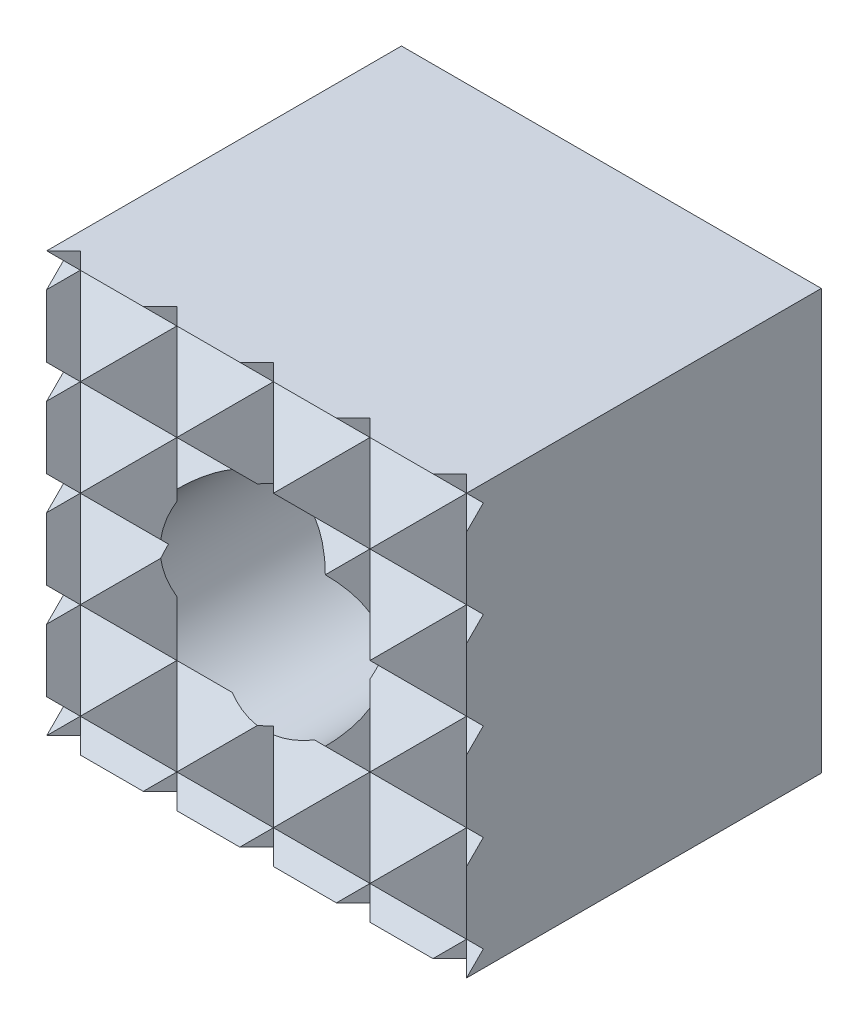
ISO-10303-21;
HEADER;
FILE_DESCRIPTION(('STEP AP214'),'2;1');
FILE_NAME('part.step','',(''),(''),'','','');
FILE_SCHEMA(('AUTOMOTIVE_DESIGN { 1 0 10303 214 1 1 1 1 }'));
ENDSEC;
DATA;
#1=APPLICATION_CONTEXT('core data for automotive mechanical design processes');
#2=APPLICATION_PROTOCOL_DEFINITION('international standard','automotive_design',2000,#1);
#3=PRODUCT_CONTEXT('',#1,'mechanical');
#4=PRODUCT('Part','Part','',(#3));
#5=PRODUCT_RELATED_PRODUCT_CATEGORY('part','',(#4));
#6=PRODUCT_DEFINITION_FORMATION('','',#4);
#7=PRODUCT_DEFINITION_CONTEXT('part definition',#1,'design');
#8=PRODUCT_DEFINITION('design','',#6,#7);
#9=PRODUCT_DEFINITION_SHAPE('','',#8);
#10=(LENGTH_UNIT() NAMED_UNIT(*) SI_UNIT(.MILLI.,.METRE.));
#11=(NAMED_UNIT(*) PLANE_ANGLE_UNIT() SI_UNIT($,.RADIAN.));
#12=(NAMED_UNIT(*) SI_UNIT($,.STERADIAN.) SOLID_ANGLE_UNIT());
#13=UNCERTAINTY_MEASURE_WITH_UNIT(LENGTH_MEASURE(1.E-05),#10,'distance_accuracy_value','');
#14=(GEOMETRIC_REPRESENTATION_CONTEXT(3) GLOBAL_UNCERTAINTY_ASSIGNED_CONTEXT((#13)) GLOBAL_UNIT_ASSIGNED_CONTEXT((#10,
#11,#12)) REPRESENTATION_CONTEXT('',''));
#15=CARTESIAN_POINT('',(0.,0.,0.));
#16=DIRECTION('',(0.,0.,1.));
#17=DIRECTION('',(1.,0.,0.));
#18=AXIS2_PLACEMENT_3D('',#15,#16,#17);
#19=CARTESIAN_POINT('',(-2.29999999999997,-10.,8.85));
#20=DIRECTION('',(0.707106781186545,0.,-0.70710678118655));
#21=DIRECTION('',(-0.70710678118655,0.,-0.707106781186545));
#22=AXIS2_PLACEMENT_3D('',#19,#20,#21);
#23=PLANE('',#22);
#24=DIRECTION('',(0.,1.,0.));
#25=VECTOR('',#24,1.);
#26=CARTESIAN_POINT('',(-2.29999999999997,-10.,8.85));
#27=LINE('',#26,#25);
#28=CARTESIAN_POINT('',(-2.29999999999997,-2.3,8.85));
#29=VERTEX_POINT('',#28);
#30=CARTESIAN_POINT('',(-2.29999999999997,-0.979795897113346,8.85));
#31=VERTEX_POINT('',#30);
#32=EDGE_CURVE('E471',#29,#31,#27,.T.);
#33=ORIENTED_EDGE('',*,*,#32,.F.);
#34=DIRECTION('',(0.577350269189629,0.577350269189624,0.577350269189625));
#35=VECTOR('',#34,1.);
#36=CARTESIAN_POINT('',(-4.86666666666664,-4.86666666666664,6.28333333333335));
#37=LINE('',#36,#35);
#38=CARTESIAN_POINT('',(-1.76776695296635,-1.76776695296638,9.38223304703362));
#39=VERTEX_POINT('',#38);
#40=EDGE_CURVE('E666',#29,#39,#37,.T.);
#41=ORIENTED_EDGE('',*,*,#40,.T.);
#42=CARTESIAN_POINT('',(0.,0.,11.15));
#43=DIRECTION('',(0.707106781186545,0.,-0.70710678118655));
#44=DIRECTION('',(0.70710678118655,0.,0.707106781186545));
#45=AXIS2_PLACEMENT_3D('',#42,#43,#44);
#46=ELLIPSE('',#45,3.53553390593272,2.5);
#47=EDGE_CURVE('E577',#39,#31,#46,.T.);
#48=ORIENTED_EDGE('',*,*,#47,.T.);
#49=EDGE_LOOP('',(#33,#41,#48));
#50=FACE_BOUND('',#49,.T.);
#51=ADVANCED_FACE('F14',(#50),#23,.F.);
#52=CARTESIAN_POINT('',(-1.14999999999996,-10.,10.));
#53=DIRECTION('',(-0.70710678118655,0.,-0.707106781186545));
#54=DIRECTION('',(-0.707106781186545,0.,0.70710678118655));
#55=AXIS2_PLACEMENT_3D('',#52,#53,#54);
#56=PLANE('',#55);
#57=DIRECTION('',(-0.707106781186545,0.,0.70710678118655));
#58=VECTOR('',#57,1.);
#59=CARTESIAN_POINT('',(-3.07499999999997,5.,11.925));
#60=LINE('',#59,#58);
#61=CARTESIAN_POINT('',(0.,5.,8.85));
#62=VERTEX_POINT('',#61);
#63=CARTESIAN_POINT('',(-0.399999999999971,5.,9.25));
#64=VERTEX_POINT('',#63);
#65=EDGE_CURVE('E496',#62,#64,#60,.T.);
#66=ORIENTED_EDGE('',*,*,#65,.T.);
#67=DIRECTION('',(0.577350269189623,-0.577350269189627,-0.577350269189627));
#68=VECTOR('',#67,1.);
#69=CARTESIAN_POINT('',(4.1,0.499999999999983,4.75));
#70=LINE('',#69,#68);
#71=CARTESIAN_POINT('',(0.,4.6,8.85));
#72=VERTEX_POINT('',#71);
#73=EDGE_CURVE('E823',#64,#72,#70,.T.);
#74=ORIENTED_EDGE('',*,*,#73,.T.);
#75=DIRECTION('',(0.,1.,0.));
#76=VECTOR('',#75,1.);
#77=CARTESIAN_POINT('',(0.,-10.,8.85));
#78=LINE('',#77,#76);
#79=EDGE_CURVE('E449',#72,#62,#78,.T.);
#80=ORIENTED_EDGE('',*,*,#79,.T.);
#81=EDGE_LOOP('',(#66,#74,#80));
#82=FACE_BOUND('',#81,.T.);
#83=ADVANCED_FACE('F1142',(#82),#56,.F.);
#84=CARTESIAN_POINT('',(0.,-10.,8.85));
#85=DIRECTION('',(0.707106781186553,0.,-0.707106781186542));
#86=DIRECTION('',(-0.707106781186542,0.,-0.707106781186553));
#87=AXIS2_PLACEMENT_3D('',#84,#85,#86);
#88=PLANE('',#87);
#89=DIRECTION('',(0.57735026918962,0.577350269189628,0.577350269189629));
#90=VECTOR('',#89,1.);
#91=CARTESIAN_POINT('',(-1.79999999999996,-6.4,7.05));
#92=LINE('',#91,#90);
#93=CARTESIAN_POINT('',(0.,-4.6,8.85));
#94=VERTEX_POINT('',#93);
#95=CARTESIAN_POINT('',(1.15,-3.45,10.));
#96=VERTEX_POINT('',#95);
#97=EDGE_CURVE('E899',#94,#96,#92,.T.);
#98=ORIENTED_EDGE('',*,*,#97,.T.);
#99=DIRECTION('',(-0.577350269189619,0.57735026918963,-0.577350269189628));
#100=VECTOR('',#99,1.);
#101=CARTESIAN_POINT('',(2.56666666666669,-4.8666666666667,11.4166666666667));
#102=LINE('',#101,#100);
#103=CARTESIAN_POINT('',(0.192572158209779,-2.49257215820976,9.04257215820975));
#104=VERTEX_POINT('',#103);
#105=EDGE_CURVE('E944',#96,#104,#102,.T.);
#106=ORIENTED_EDGE('',*,*,#105,.T.);
#107=CARTESIAN_POINT('',(0.,0.,8.85));
#108=DIRECTION('',(0.707106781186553,0.,-0.707106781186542));
#109=DIRECTION('',(0.707106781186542,0.,0.707106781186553));
#110=AXIS2_PLACEMENT_3D('',#107,#108,#109);
#111=ELLIPSE('',#110,3.53553390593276,2.5);
#112=CARTESIAN_POINT('',(0.,-2.5,8.85));
#113=VERTEX_POINT('',#112);
#114=EDGE_CURVE('E585',#104,#113,#111,.T.);
#115=ORIENTED_EDGE('',*,*,#114,.T.);
#116=EDGE_CURVE('E448',#94,#113,#78,.T.);
#117=ORIENTED_EDGE('',*,*,#116,.F.);
#118=EDGE_LOOP('',(#98,#106,#115,#117));
#119=FACE_BOUND('',#118,.T.);
#120=ADVANCED_FACE('F961',(#119),#88,.F.);
#121=CARTESIAN_POINT('',(1.15000000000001,-10.,10.));
#122=DIRECTION('',(-0.707106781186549,0.,-0.707106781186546));
#123=DIRECTION('',(-0.707106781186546,0.,0.707106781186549));
#124=AXIS2_PLACEMENT_3D('',#121,#122,#123);
#125=PLANE('',#124);
#126=DIRECTION('',(-0.707106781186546,0.,0.707106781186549));
#127=VECTOR('',#126,1.);
#128=CARTESIAN_POINT('',(-1.925,5.,13.075));
#129=LINE('',#128,#127);
#130=CARTESIAN_POINT('',(2.3,5.,8.85));
#131=VERTEX_POINT('',#130);
#132=CARTESIAN_POINT('',(1.9,5.,9.25));
#133=VERTEX_POINT('',#132);
#134=EDGE_CURVE('E485',#131,#133,#129,.T.);
#135=ORIENTED_EDGE('',*,*,#134,.T.);
#136=DIRECTION('',(0.577350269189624,-0.577350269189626,-0.577350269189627));
#137=VECTOR('',#136,1.);
#138=CARTESIAN_POINT('',(6.4,0.499999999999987,4.75));
#139=LINE('',#138,#137);
#140=CARTESIAN_POINT('',(2.3,4.6,8.85));
#141=VERTEX_POINT('',#140);
#142=EDGE_CURVE('E833',#133,#141,#139,.T.);
#143=ORIENTED_EDGE('',*,*,#142,.T.);
#144=DIRECTION('',(0.,1.,0.));
#145=VECTOR('',#144,1.);
#146=CARTESIAN_POINT('',(2.3,-10.,8.85));
#147=LINE('',#146,#145);
#148=EDGE_CURVE('E460',#141,#131,#147,.T.);
#149=ORIENTED_EDGE('',*,*,#148,.T.);
#150=EDGE_LOOP('',(#135,#143,#149));
#151=FACE_BOUND('',#150,.T.);
#152=ADVANCED_FACE('F979',(#151),#125,.F.);
#153=CARTESIAN_POINT('',(2.3,0.979795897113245,8.85));
#154=VERTEX_POINT('',#153);
#155=CARTESIAN_POINT('',(2.3,2.3,8.85));
#156=VERTEX_POINT('',#155);
#157=EDGE_CURVE('E451',#154,#156,#147,.T.);
#158=ORIENTED_EDGE('',*,*,#157,.T.);
#159=DIRECTION('',(-0.577350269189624,-0.577350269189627,0.577350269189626));
#160=VECTOR('',#159,1.);
#161=CARTESIAN_POINT('',(-2.56666666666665,-2.56666666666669,13.7166666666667));
#162=LINE('',#161,#160);
#163=CARTESIAN_POINT('',(1.76776695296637,1.76776695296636,9.38223304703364));
#164=VERTEX_POINT('',#163);
#165=EDGE_CURVE('E438',#156,#164,#162,.T.);
#166=ORIENTED_EDGE('',*,*,#165,.T.);
#167=CARTESIAN_POINT('',(0.,0.,11.15));
#168=DIRECTION('',(-0.707106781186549,0.,-0.707106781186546));
#169=DIRECTION('',(-0.707106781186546,0.,0.707106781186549));
#170=AXIS2_PLACEMENT_3D('',#167,#168,#169);
#171=ELLIPSE('',#170,3.53553390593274,2.5);
#172=EDGE_CURVE('E589',#164,#154,#171,.T.);
#173=ORIENTED_EDGE('',*,*,#172,.T.);
#174=EDGE_LOOP('',(#158,#166,#173));
#175=FACE_BOUND('',#174,.T.);
#176=ADVANCED_FACE('F1150',(#175),#125,.F.);
#177=CARTESIAN_POINT('',(-2.29999999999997,4.6,8.85));
#178=VERTEX_POINT('',#177);
#179=CARTESIAN_POINT('',(-2.29999999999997,5.,8.85));
#180=VERTEX_POINT('',#179);
#181=EDGE_CURVE('E444',#178,#180,#27,.T.);
#182=ORIENTED_EDGE('',*,*,#181,.F.);
#183=DIRECTION('',(0.577350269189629,0.577350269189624,0.577350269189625));
#184=VECTOR('',#183,1.);
#185=CARTESIAN_POINT('',(-7.16666666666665,-0.266666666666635,3.98333333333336));
#186=LINE('',#185,#184);
#187=CARTESIAN_POINT('',(-1.89999999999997,5.,9.25));
#188=VERTEX_POINT('',#187);
#189=EDGE_CURVE('E810',#178,#188,#186,.T.);
#190=ORIENTED_EDGE('',*,*,#189,.T.);
#191=DIRECTION('',(-0.70710678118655,0.,-0.707106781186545));
#192=VECTOR('',#191,1.);
#193=CARTESIAN_POINT('',(-3.075,5.,8.075));
#194=LINE('',#193,#192);
#195=EDGE_CURVE('E501',#188,#180,#194,.T.);
#196=ORIENTED_EDGE('',*,*,#195,.T.);
#197=EDGE_LOOP('',(#182,#190,#196));
#198=FACE_BOUND('',#197,.T.);
#199=ADVANCED_FACE('F1148',(#198),#23,.F.);
#200=CARTESIAN_POINT('',(-2.29999999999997,0.979795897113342,8.85));
#201=VERTEX_POINT('',#200);
#202=CARTESIAN_POINT('',(-1.76776695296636,1.76776695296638,9.38223304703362));
#203=VERTEX_POINT('',#202);
#204=EDGE_CURVE('E574',#201,#203,#46,.T.);
#205=ORIENTED_EDGE('',*,*,#204,.T.);
#206=DIRECTION('',(-0.577350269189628,0.577350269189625,-0.577350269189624));
#207=VECTOR('',#206,1.);
#208=CARTESIAN_POINT('',(1.80000000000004,-1.8,12.95));
#209=LINE('',#208,#207);
#210=CARTESIAN_POINT('',(-2.29999999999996,2.3,8.85));
#211=VERTEX_POINT('',#210);
#212=EDGE_CURVE('E428',#203,#211,#209,.T.);
#213=ORIENTED_EDGE('',*,*,#212,.T.);
#214=EDGE_CURVE('E468',#201,#211,#27,.T.);
#215=ORIENTED_EDGE('',*,*,#214,.F.);
#216=EDGE_LOOP('',(#205,#213,#215));
#217=FACE_BOUND('',#216,.T.);
#218=ADVANCED_FACE('F743',(#217),#23,.F.);
#219=CARTESIAN_POINT('',(0.,0.,8.85));
#220=DIRECTION('',(-0.70710678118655,0.,-0.707106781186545));
#221=DIRECTION('',(-0.707106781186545,0.,0.70710678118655));
#222=AXIS2_PLACEMENT_3D('',#219,#220,#221);
#223=ELLIPSE('',#222,3.53553390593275,2.5);
#224=CARTESIAN_POINT('',(-0.19257215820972,-2.49257215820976,9.04257215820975));
#225=VERTEX_POINT('',#224);
#226=EDGE_CURVE('E578',#113,#225,#223,.T.);
#227=ORIENTED_EDGE('',*,*,#226,.T.);
#228=DIRECTION('',(-0.577350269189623,-0.577350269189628,0.577350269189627));
#229=VECTOR('',#228,1.);
#230=CARTESIAN_POINT('',(-3.33333333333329,-5.63333333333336,12.1833333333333));
#231=LINE('',#230,#229);
#232=CARTESIAN_POINT('',(-1.14999999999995,-3.45,10.));
#233=VERTEX_POINT('',#232);
#234=EDGE_CURVE('E929',#225,#233,#231,.T.);
#235=ORIENTED_EDGE('',*,*,#234,.T.);
#236=DIRECTION('',(0.577350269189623,-0.577350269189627,-0.577350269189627));
#237=VECTOR('',#236,1.);
#238=CARTESIAN_POINT('',(1.03333333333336,-5.63333333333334,7.81666666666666));
#239=LINE('',#238,#237);
#240=EDGE_CURVE('E37',#233,#94,#239,.T.);
#241=ORIENTED_EDGE('',*,*,#240,.T.);
#242=ORIENTED_EDGE('',*,*,#116,.T.);
#243=EDGE_LOOP('',(#227,#235,#241,#242));
#244=FACE_BOUND('',#243,.T.);
#245=ADVANCED_FACE('F963',(#244),#56,.F.);
#246=ORIENTED_EDGE('',*,*,#79,.F.);
#247=DIRECTION('',(0.57735026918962,0.577350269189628,0.577350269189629));
#248=VECTOR('',#247,1.);
#249=CARTESIAN_POINT('',(-4.86666666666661,-0.266666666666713,3.98333333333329));
#250=LINE('',#249,#248);
#251=CARTESIAN_POINT('',(0.400000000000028,5.,9.25));
#252=VERTEX_POINT('',#251);
#253=EDGE_CURVE('E829',#72,#252,#250,.T.);
#254=ORIENTED_EDGE('',*,*,#253,.T.);
#255=DIRECTION('',(-0.707106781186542,0.,-0.707106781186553));
#256=VECTOR('',#255,1.);
#257=CARTESIAN_POINT('',(-1.92499999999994,5.,6.925));
#258=LINE('',#257,#256);
#259=EDGE_CURVE('E490',#252,#62,#258,.T.);
#260=ORIENTED_EDGE('',*,*,#259,.T.);
#261=EDGE_LOOP('',(#246,#254,#260));
#262=FACE_BOUND('',#261,.T.);
#263=ADVANCED_FACE('F1145',(#262),#88,.F.);
#264=CARTESIAN_POINT('',(2.3,-0.979795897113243,8.85));
#265=VERTEX_POINT('',#264);
#266=CARTESIAN_POINT('',(1.76776695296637,-1.76776695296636,9.38223304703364));
#267=VERTEX_POINT('',#266);
#268=EDGE_CURVE('E586',#265,#267,#171,.T.);
#269=ORIENTED_EDGE('',*,*,#268,.T.);
#270=DIRECTION('',(0.577350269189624,-0.577350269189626,-0.577350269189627));
#271=VECTOR('',#270,1.);
#272=CARTESIAN_POINT('',(4.1,-4.1,7.05));
#273=LINE('',#272,#271);
#274=CARTESIAN_POINT('',(2.3,-2.3,8.85));
#275=VERTEX_POINT('',#274);
#276=EDGE_CURVE('E690',#267,#275,#273,.T.);
#277=ORIENTED_EDGE('',*,*,#276,.T.);
#278=EDGE_CURVE('E454',#275,#265,#147,.T.);
#279=ORIENTED_EDGE('',*,*,#278,.T.);
#280=EDGE_LOOP('',(#269,#277,#279));
#281=FACE_BOUND('',#280,.T.);
#282=ADVANCED_FACE('F1159',(#281),#125,.F.);
#283=CARTESIAN_POINT('',(2.3,-10.,8.85));
#284=DIRECTION('',(0.707106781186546,0.,-0.707106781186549));
#285=DIRECTION('',(-0.707106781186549,0.,-0.707106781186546));
#286=AXIS2_PLACEMENT_3D('',#283,#284,#285);
#287=PLANE('',#286);
#288=DIRECTION('',(0.577350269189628,0.577350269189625,0.577350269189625));
#289=VECTOR('',#288,1.);
#290=CARTESIAN_POINT('',(-0.266666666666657,-4.86666666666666,6.28333333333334));
#291=LINE('',#290,#289);
#292=CARTESIAN_POINT('',(3.45,-1.15,10.));
#293=VERTEX_POINT('',#292);
#294=EDGE_CURVE('E687',#275,#293,#291,.T.);
#295=ORIENTED_EDGE('',*,*,#294,.T.);
#296=DIRECTION('',(-0.577350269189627,0.577350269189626,-0.577350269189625));
#297=VECTOR('',#296,1.);
#298=CARTESIAN_POINT('',(5.63333333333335,-3.33333333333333,12.1833333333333));
#299=LINE('',#298,#297);
#300=CARTESIAN_POINT('',(2.49257215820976,-0.192572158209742,9.04257215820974));
#301=VERTEX_POINT('',#300);
#302=EDGE_CURVE('E708',#293,#301,#299,.T.);
#303=ORIENTED_EDGE('',*,*,#302,.T.);
#304=CARTESIAN_POINT('',(0.,0.,6.55));
#305=DIRECTION('',(0.707106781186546,0.,-0.707106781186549));
#306=DIRECTION('',(0.707106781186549,0.,0.707106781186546));
#307=AXIS2_PLACEMENT_3D('',#304,#305,#306);
#308=ELLIPSE('',#307,3.53553390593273,2.5);
#309=EDGE_CURVE('E594',#301,#265,#308,.T.);
#310=ORIENTED_EDGE('',*,*,#309,.T.);
#311=ORIENTED_EDGE('',*,*,#278,.F.);
#312=EDGE_LOOP('',(#295,#303,#310,#311));
#313=FACE_BOUND('',#312,.T.);
#314=ADVANCED_FACE('F1327',(#313),#287,.F.);
#315=DIRECTION('',(0.707106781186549,0.,0.707106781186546));
#316=VECTOR('',#315,1.);
#317=CARTESIAN_POINT('',(4.225,-5.,10.775));
#318=LINE('',#317,#316);
#319=CARTESIAN_POINT('',(2.3,-5.,8.85));
#320=VERTEX_POINT('',#319);
#321=CARTESIAN_POINT('',(2.7,-5.,9.25));
#322=VERTEX_POINT('',#321);
#323=EDGE_CURVE('E482',#320,#322,#318,.T.);
#324=ORIENTED_EDGE('',*,*,#323,.T.);
#325=DIRECTION('',(-0.577350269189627,0.577350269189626,-0.577350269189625));
#326=VECTOR('',#325,1.);
#327=CARTESIAN_POINT('',(4.1,-6.4,10.65));
#328=LINE('',#327,#326);
#329=CARTESIAN_POINT('',(2.3,-4.6,8.85));
#330=VERTEX_POINT('',#329);
#331=EDGE_CURVE('E874',#322,#330,#328,.T.);
#332=ORIENTED_EDGE('',*,*,#331,.T.);
#333=EDGE_CURVE('E456',#320,#330,#147,.T.);
#334=ORIENTED_EDGE('',*,*,#333,.F.);
#335=EDGE_LOOP('',(#324,#332,#334));
#336=FACE_BOUND('',#335,.T.);
#337=ADVANCED_FACE('F1551',(#336),#287,.F.);
#338=ORIENTED_EDGE('',*,*,#148,.F.);
#339=DIRECTION('',(0.577350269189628,0.577350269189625,0.577350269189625));
#340=VECTOR('',#339,1.);
#341=CARTESIAN_POINT('',(-2.56666666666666,-0.266666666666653,3.98333333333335));
#342=LINE('',#341,#340);
#343=CARTESIAN_POINT('',(2.7,5.,9.25));
#344=VERTEX_POINT('',#343);
#345=EDGE_CURVE('E836',#141,#344,#342,.T.);
#346=ORIENTED_EDGE('',*,*,#345,.T.);
#347=DIRECTION('',(-0.707106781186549,0.,-0.707106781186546));
#348=VECTOR('',#347,1.);
#349=CARTESIAN_POINT('',(-0.775,5.,5.775));
#350=LINE('',#349,#348);
#351=EDGE_CURVE('E479',#344,#131,#350,.T.);
#352=ORIENTED_EDGE('',*,*,#351,.T.);
#353=EDGE_LOOP('',(#338,#346,#352));
#354=FACE_BOUND('',#353,.T.);
#355=ADVANCED_FACE('F983',(#354),#287,.F.);
#356=CARTESIAN_POINT('',(2.49257215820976,0.192572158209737,9.04257215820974));
#357=VERTEX_POINT('',#356);
#358=EDGE_CURVE('E590',#154,#357,#308,.T.);
#359=ORIENTED_EDGE('',*,*,#358,.T.);
#360=DIRECTION('',(0.577350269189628,0.577350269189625,0.577350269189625));
#361=VECTOR('',#360,1.);
#362=CARTESIAN_POINT('',(-1.03333333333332,-3.33333333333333,5.51666666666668));
#363=LINE('',#362,#361);
#364=CARTESIAN_POINT('',(3.45,1.15,10.));
#365=VERTEX_POINT('',#364);
#366=EDGE_CURVE('E731',#357,#365,#363,.T.);
#367=ORIENTED_EDGE('',*,*,#366,.T.);
#368=DIRECTION('',(-0.577350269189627,0.577350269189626,-0.577350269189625));
#369=VECTOR('',#368,1.);
#370=CARTESIAN_POINT('',(6.4,-1.8,12.95));
#371=LINE('',#370,#369);
#372=EDGE_CURVE('E435',#365,#156,#371,.T.);
#373=ORIENTED_EDGE('',*,*,#372,.T.);
#374=ORIENTED_EDGE('',*,*,#157,.F.);
#375=EDGE_LOOP('',(#359,#367,#373,#374));
#376=FACE_BOUND('',#375,.T.);
#377=ADVANCED_FACE('F1328',(#376),#287,.F.);
#378=CARTESIAN_POINT('',(3.45,-10.,10.));
#379=DIRECTION('',(-0.707106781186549,0.,-0.707106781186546));
#380=DIRECTION('',(-0.707106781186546,0.,0.707106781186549));
#381=AXIS2_PLACEMENT_3D('',#378,#379,#380);
#382=PLANE('',#381);
#383=DIRECTION('',(0.,1.,0.));
#384=VECTOR('',#383,1.);
#385=CARTESIAN_POINT('',(4.6,-10.,8.85));
#386=LINE('',#385,#384);
#387=CARTESIAN_POINT('',(4.6,-5.,8.85));
#388=VERTEX_POINT('',#387);
#389=CARTESIAN_POINT('',(4.6,-4.6,8.85));
#390=VERTEX_POINT('',#389);
#391=EDGE_CURVE('E457',#388,#390,#386,.T.);
#392=ORIENTED_EDGE('',*,*,#391,.T.);
#393=DIRECTION('',(-0.577350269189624,-0.577350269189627,0.577350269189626));
#394=VECTOR('',#393,1.);
#395=CARTESIAN_POINT('',(2.03333333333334,-7.16666666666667,11.4166666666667));
#396=LINE('',#395,#394);
#397=CARTESIAN_POINT('',(4.2,-5.,9.25));
#398=VERTEX_POINT('',#397);
#399=EDGE_CURVE('E877',#390,#398,#396,.T.);
#400=ORIENTED_EDGE('',*,*,#399,.T.);
#401=DIRECTION('',(0.707106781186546,0.,-0.707106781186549));
#402=VECTOR('',#401,1.);
#403=CARTESIAN_POINT('',(4.225,-5.,9.225));
#404=LINE('',#403,#402);
#405=EDGE_CURVE('E522',#398,#388,#404,.T.);
#406=ORIENTED_EDGE('',*,*,#405,.T.);
#407=EDGE_LOOP('',(#392,#400,#406));
#408=FACE_BOUND('',#407,.T.);
#409=ADVANCED_FACE('F1320',(#408),#382,.F.);
#410=DIRECTION('',(-0.577350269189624,-0.577350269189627,0.577350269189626));
#411=VECTOR('',#410,1.);
#412=CARTESIAN_POINT('',(1.26666666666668,-5.63333333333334,12.1833333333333));
#413=LINE('',#412,#411);
#414=CARTESIAN_POINT('',(4.6,-2.3,8.85));
#415=VERTEX_POINT('',#414);
#416=CARTESIAN_POINT('',(3.45,-3.45,10.));
#417=VERTEX_POINT('',#416);
#418=EDGE_CURVE('E937',#415,#417,#413,.T.);
#419=ORIENTED_EDGE('',*,*,#418,.T.);
#420=DIRECTION('',(0.577350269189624,-0.577350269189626,-0.577350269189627));
#421=VECTOR('',#420,1.);
#422=CARTESIAN_POINT('',(5.63333333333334,-5.63333333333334,7.81666666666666));
#423=LINE('',#422,#421);
#424=EDGE_CURVE('E908',#417,#390,#423,.T.);
#425=ORIENTED_EDGE('',*,*,#424,.T.);
#426=EDGE_CURVE('E461',#390,#415,#386,.T.);
#427=ORIENTED_EDGE('',*,*,#426,.T.);
#428=EDGE_LOOP('',(#419,#425,#427));
#429=FACE_BOUND('',#428,.T.);
#430=ADVANCED_FACE('F1582',(#429),#382,.F.);
#431=DIRECTION('',(-0.577350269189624,-0.577350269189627,0.577350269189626));
#432=VECTOR('',#431,1.);
#433=CARTESIAN_POINT('',(0.500000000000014,-4.1,12.95));
#434=LINE('',#433,#432);
#435=CARTESIAN_POINT('',(4.6,0.,8.85));
#436=VERTEX_POINT('',#435);
#437=EDGE_CURVE('E705',#436,#293,#434,.T.);
#438=ORIENTED_EDGE('',*,*,#437,.T.);
#439=DIRECTION('',(0.577350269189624,-0.577350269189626,-0.577350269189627));
#440=VECTOR('',#439,1.);
#441=CARTESIAN_POINT('',(6.4,-4.1,7.05));
#442=LINE('',#441,#440);
#443=EDGE_CURVE('E684',#293,#415,#442,.T.);
#444=ORIENTED_EDGE('',*,*,#443,.T.);
#445=EDGE_CURVE('E2253',#415,#436,#386,.T.);
#446=ORIENTED_EDGE('',*,*,#445,.T.);
#447=EDGE_LOOP('',(#438,#444,#446));
#448=FACE_BOUND('',#447,.T.);
#449=ADVANCED_FACE('F1591',(#448),#382,.F.);
#450=DIRECTION('',(-0.707106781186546,0.,0.707106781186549));
#451=VECTOR('',#450,1.);
#452=CARTESIAN_POINT('',(-0.77499999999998,5.,14.225));
#453=LINE('',#452,#451);
#454=CARTESIAN_POINT('',(4.6,5.,8.85));
#455=VERTEX_POINT('',#454);
#456=CARTESIAN_POINT('',(4.2,5.,9.25));
#457=VERTEX_POINT('',#456);
#458=EDGE_CURVE('E600',#455,#457,#453,.T.);
#459=ORIENTED_EDGE('',*,*,#458,.T.);
#460=DIRECTION('',(0.577350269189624,-0.577350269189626,-0.577350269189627));
#461=VECTOR('',#460,1.);
#462=CARTESIAN_POINT('',(8.7,0.499999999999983,4.75));
#463=LINE('',#462,#461);
#464=CARTESIAN_POINT('',(4.6,4.6,8.85));
#465=VERTEX_POINT('',#464);
#466=EDGE_CURVE('E839',#457,#465,#463,.T.);
#467=ORIENTED_EDGE('',*,*,#466,.T.);
#468=EDGE_CURVE('E462',#465,#455,#386,.T.);
#469=ORIENTED_EDGE('',*,*,#468,.T.);
#470=EDGE_LOOP('',(#459,#467,#469));
#471=FACE_BOUND('',#470,.T.);
#472=ADVANCED_FACE('F1000',(#471),#382,.F.);
#473=DIRECTION('',(-0.577350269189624,-0.577350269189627,0.577350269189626));
#474=VECTOR('',#473,1.);
#475=CARTESIAN_POINT('',(-0.266666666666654,-2.56666666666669,13.7166666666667));
#476=LINE('',#475,#474);
#477=CARTESIAN_POINT('',(4.6,2.3,8.85));
#478=VERTEX_POINT('',#477);
#479=EDGE_CURVE('E426',#478,#365,#476,.T.);
#480=ORIENTED_EDGE('',*,*,#479,.T.);
#481=DIRECTION('',(0.577350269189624,-0.577350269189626,-0.577350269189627));
#482=VECTOR('',#481,1.);
#483=CARTESIAN_POINT('',(7.16666666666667,-2.56666666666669,6.28333333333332));
#484=LINE('',#483,#482);
#485=EDGE_CURVE('E728',#365,#436,#484,.T.);
#486=ORIENTED_EDGE('',*,*,#485,.T.);
#487=EDGE_CURVE('E1432',#436,#478,#386,.T.);
#488=ORIENTED_EDGE('',*,*,#487,.T.);
#489=EDGE_LOOP('',(#480,#486,#488));
#490=FACE_BOUND('',#489,.T.);
#491=ADVANCED_FACE('F1321',(#490),#382,.F.);
#492=CARTESIAN_POINT('',(4.6,-10.,8.85));
#493=DIRECTION('',(0.707106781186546,0.,-0.707106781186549));
#494=DIRECTION('',(-0.707106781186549,0.,-0.707106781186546));
#495=AXIS2_PLACEMENT_3D('',#492,#493,#494);
#496=PLANE('',#495);
#497=ORIENTED_EDGE('',*,*,#487,.F.);
#498=DIRECTION('',(0.577350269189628,0.577350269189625,0.577350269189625));
#499=VECTOR('',#498,1.);
#500=CARTESIAN_POINT('',(1.26666666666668,-3.33333333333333,5.51666666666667));
#501=LINE('',#500,#499);
#502=CARTESIAN_POINT('',(5.,0.399999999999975,9.25));
#503=VERTEX_POINT('',#502);
#504=EDGE_CURVE('E725',#436,#503,#501,.T.);
#505=ORIENTED_EDGE('',*,*,#504,.T.);
#506=DIRECTION('',(0.,-1.,0.));
#507=VECTOR('',#506,1.);
#508=CARTESIAN_POINT('',(5.,-5.,9.25));
#509=LINE('',#508,#507);
#510=CARTESIAN_POINT('',(5.,1.90000000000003,9.25));
#511=VERTEX_POINT('',#510);
#512=EDGE_CURVE('E2265',#511,#503,#509,.T.);
#513=ORIENTED_EDGE('',*,*,#512,.F.);
#514=DIRECTION('',(-0.577350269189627,0.577350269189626,-0.577350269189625));
#515=VECTOR('',#514,1.);
#516=CARTESIAN_POINT('',(8.7,-1.8,12.95));
#517=LINE('',#516,#515);
#518=EDGE_CURVE('E422',#511,#478,#517,.T.);
#519=ORIENTED_EDGE('',*,*,#518,.T.);
#520=EDGE_LOOP('',(#497,#505,#513,#519));
#521=FACE_BOUND('',#520,.T.);
#522=ADVANCED_FACE('F1314',(#521),#496,.F.);
#523=CARTESIAN_POINT('',(5.,-0.399999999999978,9.25));
#524=VERTEX_POINT('',#523);
#525=CARTESIAN_POINT('',(5.,-1.90000000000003,9.25));
#526=VERTEX_POINT('',#525);
#527=EDGE_CURVE('E517',#524,#526,#509,.T.);
#528=ORIENTED_EDGE('',*,*,#527,.F.);
#529=DIRECTION('',(-0.577350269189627,0.577350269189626,-0.577350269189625));
#530=VECTOR('',#529,1.);
#531=CARTESIAN_POINT('',(7.93333333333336,-3.33333333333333,12.1833333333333));
#532=LINE('',#531,#530);
#533=EDGE_CURVE('E702',#524,#436,#532,.T.);
#534=ORIENTED_EDGE('',*,*,#533,.T.);
#535=ORIENTED_EDGE('',*,*,#445,.F.);
#536=DIRECTION('',(0.577350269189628,0.577350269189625,0.577350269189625));
#537=VECTOR('',#536,1.);
#538=CARTESIAN_POINT('',(2.03333333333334,-4.86666666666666,6.28333333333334));
#539=LINE('',#538,#537);
#540=EDGE_CURVE('E681',#415,#526,#539,.T.);
#541=ORIENTED_EDGE('',*,*,#540,.T.);
#542=EDGE_LOOP('',(#528,#534,#535,#541));
#543=FACE_BOUND('',#542,.T.);
#544=ADVANCED_FACE('F1622',(#543),#496,.F.);
#545=CARTESIAN_POINT('',(5.,-2.7,9.25));
#546=VERTEX_POINT('',#545);
#547=CARTESIAN_POINT('',(5.,-4.2,9.25));
#548=VERTEX_POINT('',#547);
#549=EDGE_CURVE('E514',#546,#548,#509,.T.);
#550=ORIENTED_EDGE('',*,*,#549,.F.);
#551=DIRECTION('',(-0.577350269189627,0.577350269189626,-0.577350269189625));
#552=VECTOR('',#551,1.);
#553=CARTESIAN_POINT('',(7.16666666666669,-4.86666666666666,11.4166666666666));
#554=LINE('',#553,#552);
#555=EDGE_CURVE('E934',#546,#415,#554,.T.);
#556=ORIENTED_EDGE('',*,*,#555,.T.);
#557=ORIENTED_EDGE('',*,*,#426,.F.);
#558=DIRECTION('',(0.577350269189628,0.577350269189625,0.577350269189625));
#559=VECTOR('',#558,1.);
#560=CARTESIAN_POINT('',(2.8,-6.4,7.05));
#561=LINE('',#560,#559);
#562=EDGE_CURVE('E911',#390,#548,#561,.T.);
#563=ORIENTED_EDGE('',*,*,#562,.T.);
#564=EDGE_LOOP('',(#550,#556,#557,#563));
#565=FACE_BOUND('',#564,.T.);
#566=ADVANCED_FACE('F1631',(#565),#496,.F.);
#567=ORIENTED_EDGE('',*,*,#468,.F.);
#568=DIRECTION('',(0.577350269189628,0.577350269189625,0.577350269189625));
#569=VECTOR('',#568,1.);
#570=CARTESIAN_POINT('',(-0.266666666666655,-0.266666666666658,3.98333333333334));
#571=LINE('',#570,#569);
#572=CARTESIAN_POINT('',(5.,5.,9.25));
#573=VERTEX_POINT('',#572);
#574=EDGE_CURVE('E842',#465,#573,#571,.T.);
#575=ORIENTED_EDGE('',*,*,#574,.T.);
#576=DIRECTION('',(-0.707106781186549,0.,-0.707106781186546));
#577=VECTOR('',#576,1.);
#578=CARTESIAN_POINT('',(0.374999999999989,5.,4.625));
#579=LINE('',#578,#577);
#580=EDGE_CURVE('E603',#573,#455,#579,.T.);
#581=ORIENTED_EDGE('',*,*,#580,.T.);
#582=EDGE_LOOP('',(#567,#575,#581));
#583=FACE_BOUND('',#582,.T.);
#584=ADVANCED_FACE('F1004',(#583),#496,.F.);
#585=DIRECTION('',(0.707106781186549,0.,0.707106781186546));
#586=VECTOR('',#585,1.);
#587=CARTESIAN_POINT('',(5.375,-5.,9.625));
#588=LINE('',#587,#586);
#589=CARTESIAN_POINT('',(5.,-5.,9.25));
#590=VERTEX_POINT('',#589);
#591=EDGE_CURVE('E519',#388,#590,#588,.T.);
#592=ORIENTED_EDGE('',*,*,#591,.T.);
#593=DIRECTION('',(-0.577350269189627,0.577350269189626,-0.577350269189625));
#594=VECTOR('',#593,1.);
#595=CARTESIAN_POINT('',(6.4,-6.4,10.65));
#596=LINE('',#595,#594);
#597=EDGE_CURVE('E880',#590,#390,#596,.T.);
#598=ORIENTED_EDGE('',*,*,#597,.T.);
#599=ORIENTED_EDGE('',*,*,#391,.F.);
#600=EDGE_LOOP('',(#592,#598,#599));
#601=FACE_BOUND('',#600,.T.);
#602=ADVANCED_FACE('F1315',(#601),#496,.F.);
#603=CARTESIAN_POINT('',(-5.75,-10.,10.));
#604=DIRECTION('',(-0.70710678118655,0.,-0.707106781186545));
#605=DIRECTION('',(-0.707106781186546,0.,0.70710678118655));
#606=AXIS2_PLACEMENT_3D('',#603,#604,#605);
#607=PLANE('',#606);
#608=DIRECTION('',(0.,1.,0.));
#609=VECTOR('',#608,1.);
#610=CARTESIAN_POINT('',(-5.,5.,9.25));
#611=LINE('',#610,#609);
#612=CARTESIAN_POINT('',(-5.,0.400000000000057,9.25));
#613=VERTEX_POINT('',#612);
#614=CARTESIAN_POINT('',(-5.,1.89999999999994,9.25));
#615=VERTEX_POINT('',#614);
#616=EDGE_CURVE('E421',#613,#615,#611,.T.);
#617=ORIENTED_EDGE('',*,*,#616,.F.);
#618=DIRECTION('',(0.577350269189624,-0.577350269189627,-0.577350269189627));
#619=VECTOR('',#618,1.);
#620=CARTESIAN_POINT('',(-2.0333333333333,-2.56666666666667,6.28333333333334));
#621=LINE('',#620,#619);
#622=CARTESIAN_POINT('',(-4.6,0.,8.85));
#623=VERTEX_POINT('',#622);
#624=EDGE_CURVE('E717',#613,#623,#621,.T.);
#625=ORIENTED_EDGE('',*,*,#624,.T.);
#626=DIRECTION('',(0.,1.,0.));
#627=VECTOR('',#626,1.);
#628=CARTESIAN_POINT('',(-4.6,-10.,8.85));
#629=LINE('',#628,#627);
#630=CARTESIAN_POINT('',(-4.6,2.3,8.85));
#631=VERTEX_POINT('',#630);
#632=EDGE_CURVE('E1260',#623,#631,#629,.T.);
#633=ORIENTED_EDGE('',*,*,#632,.T.);
#634=DIRECTION('',(-0.577350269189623,-0.577350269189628,0.577350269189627));
#635=VECTOR('',#634,1.);
#636=CARTESIAN_POINT('',(-9.46666666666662,-2.56666666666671,13.7166666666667));
#637=LINE('',#636,#635);
#638=EDGE_CURVE('E410',#631,#615,#637,.T.);
#639=ORIENTED_EDGE('',*,*,#638,.T.);
#640=EDGE_LOOP('',(#617,#625,#633,#639));
#641=FACE_BOUND('',#640,.T.);
#642=ADVANCED_FACE('F1258',(#641),#607,.F.);
#643=CARTESIAN_POINT('',(-4.6,-2.3,8.85));
#644=VERTEX_POINT('',#643);
#645=EDGE_CURVE('E661',#644,#623,#629,.T.);
#646=ORIENTED_EDGE('',*,*,#645,.T.);
#647=DIRECTION('',(-0.577350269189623,-0.577350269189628,0.577350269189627));
#648=VECTOR('',#647,1.);
#649=CARTESIAN_POINT('',(-8.7,-4.1,12.95));
#650=LINE('',#649,#648);
#651=CARTESIAN_POINT('',(-5.,-0.400000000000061,9.25));
#652=VERTEX_POINT('',#651);
#653=EDGE_CURVE('E657',#623,#652,#650,.T.);
#654=ORIENTED_EDGE('',*,*,#653,.T.);
#655=CARTESIAN_POINT('',(-5.,-1.89999999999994,9.25));
#656=VERTEX_POINT('',#655);
#657=EDGE_CURVE('E1246',#656,#652,#611,.T.);
#658=ORIENTED_EDGE('',*,*,#657,.F.);
#659=DIRECTION('',(0.577350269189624,-0.577350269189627,-0.577350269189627));
#660=VECTOR('',#659,1.);
#661=CARTESIAN_POINT('',(-2.79999999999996,-4.1,7.05));
#662=LINE('',#661,#660);
#663=EDGE_CURVE('E663',#656,#644,#662,.T.);
#664=ORIENTED_EDGE('',*,*,#663,.T.);
#665=EDGE_LOOP('',(#646,#654,#658,#664));
#666=FACE_BOUND('',#665,.T.);
#667=ADVANCED_FACE('F1250',(#666),#607,.F.);
#668=CARTESIAN_POINT('',(-4.6,-4.6,8.85));
#669=VERTEX_POINT('',#668);
#670=EDGE_CURVE('E466',#669,#644,#629,.T.);
#671=ORIENTED_EDGE('',*,*,#670,.T.);
#672=DIRECTION('',(-0.577350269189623,-0.577350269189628,0.577350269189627));
#673=VECTOR('',#672,1.);
#674=CARTESIAN_POINT('',(-7.93333333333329,-5.63333333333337,12.1833333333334));
#675=LINE('',#674,#673);
#676=CARTESIAN_POINT('',(-5.,-2.70000000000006,9.25));
#677=VERTEX_POINT('',#676);
#678=EDGE_CURVE('E920',#644,#677,#675,.T.);
#679=ORIENTED_EDGE('',*,*,#678,.T.);
#680=CARTESIAN_POINT('',(-5.,-4.19999999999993,9.25));
#681=VERTEX_POINT('',#680);
#682=EDGE_CURVE('E511',#681,#677,#611,.T.);
#683=ORIENTED_EDGE('',*,*,#682,.F.);
#684=DIRECTION('',(0.577350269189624,-0.577350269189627,-0.577350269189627));
#685=VECTOR('',#684,1.);
#686=CARTESIAN_POINT('',(-3.56666666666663,-5.63333333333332,7.81666666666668));
#687=LINE('',#686,#685);
#688=EDGE_CURVE('E889',#681,#669,#687,.T.);
#689=ORIENTED_EDGE('',*,*,#688,.T.);
#690=EDGE_LOOP('',(#671,#679,#683,#689));
#691=FACE_BOUND('',#690,.T.);
#692=ADVANCED_FACE('F1244',(#691),#607,.F.);
#693=DIRECTION('',(-0.707106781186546,0.,0.70710678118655));
#694=VECTOR('',#693,1.);
#695=CARTESIAN_POINT('',(-5.375,5.,9.625));
#696=LINE('',#695,#694);
#697=CARTESIAN_POINT('',(-4.6,5.,8.85));
#698=VERTEX_POINT('',#697);
#699=CARTESIAN_POINT('',(-5.,5.,9.25));
#700=VERTEX_POINT('',#699);
#701=EDGE_CURVE('E597',#698,#700,#696,.T.);
#702=ORIENTED_EDGE('',*,*,#701,.T.);
#703=DIRECTION('',(0.577350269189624,-0.577350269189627,-0.577350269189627));
#704=VECTOR('',#703,1.);
#705=CARTESIAN_POINT('',(-0.499999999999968,0.5,4.75));
#706=LINE('',#705,#704);
#707=CARTESIAN_POINT('',(-4.6,4.6,8.85));
#708=VERTEX_POINT('',#707);
#709=EDGE_CURVE('E820',#700,#708,#706,.T.);
#710=ORIENTED_EDGE('',*,*,#709,.T.);
#711=EDGE_CURVE('E467',#708,#698,#629,.T.);
#712=ORIENTED_EDGE('',*,*,#711,.T.);
#713=EDGE_LOOP('',(#702,#710,#712));
#714=FACE_BOUND('',#713,.T.);
#715=ADVANCED_FACE('F1029',(#714),#607,.F.);
#716=CARTESIAN_POINT('',(-4.6,-5.,8.85));
#717=VERTEX_POINT('',#716);
#718=EDGE_CURVE('E463',#717,#669,#629,.T.);
#719=ORIENTED_EDGE('',*,*,#718,.T.);
#720=DIRECTION('',(-0.577350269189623,-0.577350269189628,0.577350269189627));
#721=VECTOR('',#720,1.);
#722=CARTESIAN_POINT('',(-7.16666666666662,-7.1666666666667,11.4166666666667));
#723=LINE('',#722,#721);
#724=CARTESIAN_POINT('',(-4.99999999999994,-5.,9.25));
#725=VERTEX_POINT('',#724);
#726=EDGE_CURVE('E858',#669,#725,#723,.T.);
#727=ORIENTED_EDGE('',*,*,#726,.T.);
#728=DIRECTION('',(0.707106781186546,0.,-0.70710678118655));
#729=VECTOR('',#728,1.);
#730=CARTESIAN_POINT('',(-0.375,-5.,4.625));
#731=LINE('',#730,#729);
#732=EDGE_CURVE('E512',#725,#717,#731,.T.);
#733=ORIENTED_EDGE('',*,*,#732,.T.);
#734=EDGE_LOOP('',(#719,#727,#733));
#735=FACE_BOUND('',#734,.T.);
#736=ADVANCED_FACE('F1233',(#735),#607,.F.);
#737=CARTESIAN_POINT('',(-4.6,-10.,8.85));
#738=DIRECTION('',(0.707106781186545,0.,-0.70710678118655));
#739=DIRECTION('',(-0.70710678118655,0.,-0.707106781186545));
#740=AXIS2_PLACEMENT_3D('',#737,#738,#739);
#741=PLANE('',#740);
#742=DIRECTION('',(0.70710678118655,0.,0.707106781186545));
#743=VECTOR('',#742,1.);
#744=CARTESIAN_POINT('',(0.775000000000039,-5.,14.225));
#745=LINE('',#744,#743);
#746=CARTESIAN_POINT('',(-4.2,-5.,9.25));
#747=VERTEX_POINT('',#746);
#748=EDGE_CURVE('E506',#717,#747,#745,.T.);
#749=ORIENTED_EDGE('',*,*,#748,.T.);
#750=DIRECTION('',(-0.577350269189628,0.577350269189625,-0.577350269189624));
#751=VECTOR('',#750,1.);
#752=CARTESIAN_POINT('',(-2.8,-6.4,10.65));
#753=LINE('',#752,#751);
#754=EDGE_CURVE('E855',#747,#669,#753,.T.);
#755=ORIENTED_EDGE('',*,*,#754,.T.);
#756=ORIENTED_EDGE('',*,*,#718,.F.);
#757=EDGE_LOOP('',(#749,#755,#756));
#758=FACE_BOUND('',#757,.T.);
#759=ADVANCED_FACE('F1231',(#758),#741,.F.);
#760=ORIENTED_EDGE('',*,*,#670,.F.);
#761=DIRECTION('',(0.577350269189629,0.577350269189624,0.577350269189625));
#762=VECTOR('',#761,1.);
#763=CARTESIAN_POINT('',(-6.4,-6.4,7.05));
#764=LINE('',#763,#762);
#765=CARTESIAN_POINT('',(-3.44999999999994,-3.45,10.));
#766=VERTEX_POINT('',#765);
#767=EDGE_CURVE('E886',#669,#766,#764,.T.);
#768=ORIENTED_EDGE('',*,*,#767,.T.);
#769=DIRECTION('',(-0.577350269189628,0.577350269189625,-0.577350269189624));
#770=VECTOR('',#769,1.);
#771=CARTESIAN_POINT('',(-2.0333333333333,-4.86666666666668,11.4166666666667));
#772=LINE('',#771,#770);
#773=EDGE_CURVE('E917',#766,#644,#772,.T.);
#774=ORIENTED_EDGE('',*,*,#773,.T.);
#775=EDGE_LOOP('',(#760,#768,#774));
#776=FACE_BOUND('',#775,.T.);
#777=ADVANCED_FACE('F1300',(#776),#741,.F.);
#778=ORIENTED_EDGE('',*,*,#645,.F.);
#779=DIRECTION('',(0.577350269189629,0.577350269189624,0.577350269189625));
#780=VECTOR('',#779,1.);
#781=CARTESIAN_POINT('',(-7.16666666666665,-4.86666666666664,6.28333333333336));
#782=LINE('',#781,#780);
#783=CARTESIAN_POINT('',(-3.44999999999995,-1.15,10.));
#784=VERTEX_POINT('',#783);
#785=EDGE_CURVE('E641',#644,#784,#782,.T.);
#786=ORIENTED_EDGE('',*,*,#785,.T.);
#787=DIRECTION('',(-0.577350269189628,0.577350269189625,-0.577350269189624));
#788=VECTOR('',#787,1.);
#789=CARTESIAN_POINT('',(-1.26666666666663,-3.33333333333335,12.1833333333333));
#790=LINE('',#789,#788);
#791=EDGE_CURVE('E648',#784,#623,#790,.T.);
#792=ORIENTED_EDGE('',*,*,#791,.T.);
#793=EDGE_LOOP('',(#778,#786,#792));
#794=FACE_BOUND('',#793,.T.);
#795=ADVANCED_FACE('F660',(#794),#741,.F.);
#796=ORIENTED_EDGE('',*,*,#711,.F.);
#797=DIRECTION('',(0.577350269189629,0.577350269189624,0.577350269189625));
#798=VECTOR('',#797,1.);
#799=CARTESIAN_POINT('',(-9.46666666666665,-0.266666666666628,3.98333333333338));
#800=LINE('',#799,#798);
#801=CARTESIAN_POINT('',(-4.2,5.,9.25));
#802=VERTEX_POINT('',#801);
#803=EDGE_CURVE('E817',#708,#802,#800,.T.);
#804=ORIENTED_EDGE('',*,*,#803,.T.);
#805=DIRECTION('',(-0.70710678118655,0.,-0.707106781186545));
#806=VECTOR('',#805,1.);
#807=CARTESIAN_POINT('',(-4.225,5.,9.225));
#808=LINE('',#807,#806);
#809=EDGE_CURVE('E593',#802,#698,#808,.T.);
#810=ORIENTED_EDGE('',*,*,#809,.T.);
#811=EDGE_LOOP('',(#796,#804,#810));
#812=FACE_BOUND('',#811,.T.);
#813=ADVANCED_FACE('F1033',(#812),#741,.F.);
#814=ORIENTED_EDGE('',*,*,#632,.F.);
#815=DIRECTION('',(0.577350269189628,0.577350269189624,0.577350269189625));
#816=VECTOR('',#815,1.);
#817=CARTESIAN_POINT('',(-7.93333333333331,-3.33333333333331,5.5166666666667));
#818=LINE('',#817,#816);
#819=CARTESIAN_POINT('',(-3.44999999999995,1.15,10.));
#820=VERTEX_POINT('',#819);
#821=EDGE_CURVE('E714',#623,#820,#818,.T.);
#822=ORIENTED_EDGE('',*,*,#821,.T.);
#823=DIRECTION('',(-0.577350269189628,0.577350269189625,-0.577350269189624));
#824=VECTOR('',#823,1.);
#825=CARTESIAN_POINT('',(-0.499999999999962,-1.8,12.95));
#826=LINE('',#825,#824);
#827=EDGE_CURVE('E737',#820,#631,#826,.T.);
#828=ORIENTED_EDGE('',*,*,#827,.T.);
#829=EDGE_LOOP('',(#814,#822,#828));
#830=FACE_BOUND('',#829,.T.);
#831=ADVANCED_FACE('F1282',(#830),#741,.F.);
#832=CARTESIAN_POINT('',(-3.44999999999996,-10.,10.));
#833=DIRECTION('',(-0.70710678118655,0.,-0.707106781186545));
#834=DIRECTION('',(-0.707106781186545,0.,0.70710678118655));
#835=AXIS2_PLACEMENT_3D('',#832,#833,#834);
#836=PLANE('',#835);
#837=CARTESIAN_POINT('',(0.,0.,6.55));
#838=DIRECTION('',(-0.70710678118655,0.,-0.707106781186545));
#839=DIRECTION('',(-0.707106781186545,0.,0.70710678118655));
#840=AXIS2_PLACEMENT_3D('',#837,#838,#839);
#841=ELLIPSE('',#840,3.53553390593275,2.5);
#842=CARTESIAN_POINT('',(-2.49257215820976,-0.192572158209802,9.0425721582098));
#843=VERTEX_POINT('',#842);
#844=EDGE_CURVE('E571',#31,#843,#841,.T.);
#845=ORIENTED_EDGE('',*,*,#844,.T.);
#846=DIRECTION('',(-0.577350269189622,-0.577350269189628,0.577350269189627));
#847=VECTOR('',#846,1.);
#848=CARTESIAN_POINT('',(-6.4,-4.1,12.95));
#849=LINE('',#848,#847);
#850=EDGE_CURVE('E9',#843,#784,#849,.T.);
#851=ORIENTED_EDGE('',*,*,#850,.T.);
#852=DIRECTION('',(0.577350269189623,-0.577350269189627,-0.577350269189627));
#853=VECTOR('',#852,1.);
#854=CARTESIAN_POINT('',(-0.499999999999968,-4.1,7.05));
#855=LINE('',#854,#853);
#856=EDGE_CURVE('E22',#784,#29,#855,.T.);
#857=ORIENTED_EDGE('',*,*,#856,.T.);
#858=ORIENTED_EDGE('',*,*,#32,.T.);
#859=EDGE_LOOP('',(#845,#851,#857,#858));
#860=FACE_BOUND('',#859,.T.);
#861=ADVANCED_FACE('F632',(#860),#836,.F.);
#862=CARTESIAN_POINT('',(-2.29999999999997,-5.,8.85));
#863=VERTEX_POINT('',#862);
#864=CARTESIAN_POINT('',(-2.29999999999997,-4.6,8.85));
#865=VERTEX_POINT('',#864);
#866=EDGE_CURVE('E473',#863,#865,#27,.T.);
#867=ORIENTED_EDGE('',*,*,#866,.T.);
#868=DIRECTION('',(-0.577350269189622,-0.577350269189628,0.577350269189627));
#869=VECTOR('',#868,1.);
#870=CARTESIAN_POINT('',(-4.86666666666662,-7.16666666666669,11.4166666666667));
#871=LINE('',#870,#869);
#872=CARTESIAN_POINT('',(-2.69999999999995,-5.,9.25));
#873=VERTEX_POINT('',#872);
#874=EDGE_CURVE('E621',#865,#873,#871,.T.);
#875=ORIENTED_EDGE('',*,*,#874,.T.);
#876=DIRECTION('',(0.707106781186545,0.,-0.70710678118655));
#877=VECTOR('',#876,1.);
#878=CARTESIAN_POINT('',(0.775,-5.,5.775));
#879=LINE('',#878,#877);
#880=EDGE_CURVE('E477',#873,#863,#879,.T.);
#881=ORIENTED_EDGE('',*,*,#880,.T.);
#882=EDGE_LOOP('',(#867,#875,#881));
#883=FACE_BOUND('',#882,.T.);
#884=ADVANCED_FACE('F1051',(#883),#836,.F.);
#885=DIRECTION('',(-0.707106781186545,0.,0.70710678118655));
#886=VECTOR('',#885,1.);
#887=CARTESIAN_POINT('',(-4.225,5.,10.775));
#888=LINE('',#887,#886);
#889=CARTESIAN_POINT('',(-2.69999999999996,5.,9.25));
#890=VERTEX_POINT('',#889);
#891=EDGE_CURVE('E474',#180,#890,#888,.T.);
#892=ORIENTED_EDGE('',*,*,#891,.T.);
#893=DIRECTION('',(0.577350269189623,-0.577350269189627,-0.577350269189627));
#894=VECTOR('',#893,1.);
#895=CARTESIAN_POINT('',(1.80000000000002,0.499999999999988,4.75));
#896=LINE('',#895,#894);
#897=EDGE_CURVE('E612',#890,#178,#896,.T.);
#898=ORIENTED_EDGE('',*,*,#897,.T.);
#899=ORIENTED_EDGE('',*,*,#181,.T.);
#900=EDGE_LOOP('',(#892,#898,#899));
#901=FACE_BOUND('',#900,.T.);
#902=ADVANCED_FACE('F1041',(#901),#836,.F.);
#903=DIRECTION('',(-0.577350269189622,-0.577350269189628,0.577350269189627));
#904=VECTOR('',#903,1.);
#905=CARTESIAN_POINT('',(-7.16666666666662,-2.56666666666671,13.7166666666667));
#906=LINE('',#905,#904);
#907=EDGE_CURVE('E615',#211,#820,#906,.T.);
#908=ORIENTED_EDGE('',*,*,#907,.T.);
#909=DIRECTION('',(0.577350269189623,-0.577350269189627,-0.577350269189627));
#910=VECTOR('',#909,1.);
#911=CARTESIAN_POINT('',(0.266666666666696,-2.56666666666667,6.28333333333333));
#912=LINE('',#911,#910);
#913=CARTESIAN_POINT('',(-2.49257215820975,0.192572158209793,9.0425721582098));
#914=VERTEX_POINT('',#913);
#915=EDGE_CURVE('E618',#820,#914,#912,.T.);
#916=ORIENTED_EDGE('',*,*,#915,.T.);
#917=EDGE_CURVE('E561',#914,#201,#841,.T.);
#918=ORIENTED_EDGE('',*,*,#917,.T.);
#919=ORIENTED_EDGE('',*,*,#214,.T.);
#920=EDGE_LOOP('',(#908,#916,#918,#919));
#921=FACE_BOUND('',#920,.T.);
#922=ADVANCED_FACE('F1174',(#921),#836,.F.);
#923=CARTESIAN_POINT('',(-5.,-5.,0.));
#924=DIRECTION('',(0.,0.,-1.));
#925=DIRECTION('',(-1.,0.,0.));
#926=AXIS2_PLACEMENT_3D('',#923,#924,#925);
#927=PLANE('',#926);
#928=DIRECTION('',(-1.,0.,0.));
#929=VECTOR('',#928,1.);
#930=CARTESIAN_POINT('',(-5.,-4.2,0.));
#931=LINE('',#930,#929);
#932=CARTESIAN_POINT('',(4.2,-4.2,0.));
#933=VERTEX_POINT('',#932);
#934=CARTESIAN_POINT('',(-4.2,-4.2,0.));
#935=VERTEX_POINT('',#934);
#936=EDGE_CURVE('E547',#933,#935,#931,.T.);
#937=ORIENTED_EDGE('',*,*,#936,.T.);
#938=DIRECTION('',(0.,1.,0.));
#939=VECTOR('',#938,1.);
#940=CARTESIAN_POINT('',(-4.2,5.,0.));
#941=LINE('',#940,#939);
#942=CARTESIAN_POINT('',(-4.2,4.2,0.));
#943=VERTEX_POINT('',#942);
#944=EDGE_CURVE('E549',#935,#943,#941,.T.);
#945=ORIENTED_EDGE('',*,*,#944,.T.);
#946=DIRECTION('',(1.,0.,0.));
#947=VECTOR('',#946,1.);
#948=CARTESIAN_POINT('',(-5.,4.2,0.));
#949=LINE('',#948,#947);
#950=CARTESIAN_POINT('',(4.2,4.2,0.));
#951=VERTEX_POINT('',#950);
#952=EDGE_CURVE('E543',#943,#951,#949,.T.);
#953=ORIENTED_EDGE('',*,*,#952,.T.);
#954=DIRECTION('',(0.,-1.,0.));
#955=VECTOR('',#954,1.);
#956=CARTESIAN_POINT('',(4.2,-5.,0.));
#957=LINE('',#956,#955);
#958=EDGE_CURVE('E545',#951,#933,#957,.T.);
#959=ORIENTED_EDGE('',*,*,#958,.T.);
#960=EDGE_LOOP('',(#937,#945,#953,#959));
#961=FACE_BOUND('',#960,.T.);
#962=CARTESIAN_POINT('',(0.,0.,0.));
#963=DIRECTION('',(0.,0.,-1.));
#964=DIRECTION('',(-1.,0.,0.));
#965=AXIS2_PLACEMENT_3D('',#962,#963,#964);
#966=CIRCLE('',#965,2.95);
#967=CARTESIAN_POINT('',(-2.95,0.,0.));
#968=VERTEX_POINT('',#967);
#969=EDGE_CURVE('E534',#968,#968,#966,.F.);
#970=ORIENTED_EDGE('',*,*,#969,.T.);
#971=EDGE_LOOP('',(#970));
#972=FACE_BOUND('',#971,.T.);
#973=ADVANCED_FACE('F1208',(#961,#972),#927,.T.);
#974=CARTESIAN_POINT('',(-5.,5.,10.));
#975=DIRECTION('',(1.,0.,0.));
#976=DIRECTION('',(0.,1.,0.));
#977=AXIS2_PLACEMENT_3D('',#974,#975,#976);
#978=PLANE('',#977);
#979=DIRECTION('',(0.,0.707106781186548,-0.707106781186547));
#980=VECTOR('',#979,1.);
#981=CARTESIAN_POINT('',(-5.,1.925,6.925));
#982=LINE('',#981,#980);
#983=CARTESIAN_POINT('',(-5.,0.,8.85));
#984=VERTEX_POINT('',#983);
#985=EDGE_CURVE('E699',#652,#984,#982,.T.);
#986=ORIENTED_EDGE('',*,*,#985,.T.);
#987=DIRECTION('',(0.,0.707106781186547,0.707106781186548));
#988=VECTOR('',#987,1.);
#989=CARTESIAN_POINT('',(-5.,3.075,11.925));
#990=LINE('',#989,#988);
#991=EDGE_CURVE('E722',#984,#613,#990,.T.);
#992=ORIENTED_EDGE('',*,*,#991,.T.);
#993=ORIENTED_EDGE('',*,*,#616,.T.);
#994=DIRECTION('',(0.,0.707106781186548,-0.707106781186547));
#995=VECTOR('',#994,1.);
#996=CARTESIAN_POINT('',(-5.,3.075,8.075));
#997=LINE('',#996,#995);
#998=CARTESIAN_POINT('',(-5.,2.3,8.85));
#999=VERTEX_POINT('',#998);
#1000=EDGE_CURVE('E408',#615,#999,#997,.T.);
#1001=ORIENTED_EDGE('',*,*,#1000,.T.);
#1002=DIRECTION('',(0.,0.707106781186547,0.707106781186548));
#1003=VECTOR('',#1002,1.);
#1004=CARTESIAN_POINT('',(-5.,4.225,10.775));
#1005=LINE('',#1004,#1003);
#1006=CARTESIAN_POINT('',(-5.,2.70000000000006,9.25));
#1007=VERTEX_POINT('',#1006);
#1008=EDGE_CURVE('E392',#999,#1007,#1005,.T.);
#1009=ORIENTED_EDGE('',*,*,#1008,.T.);
#1010=CARTESIAN_POINT('',(-5.,4.19999999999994,9.25));
#1011=VERTEX_POINT('',#1010);
#1012=EDGE_CURVE('E509',#1007,#1011,#611,.T.);
#1013=ORIENTED_EDGE('',*,*,#1012,.T.);
#1014=DIRECTION('',(0.,0.707106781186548,-0.707106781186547));
#1015=VECTOR('',#1014,1.);
#1016=CARTESIAN_POINT('',(-5.,4.225,9.225));
#1017=LINE('',#1016,#1015);
#1018=CARTESIAN_POINT('',(-5.,4.6,8.85));
#1019=VERTEX_POINT('',#1018);
#1020=EDGE_CURVE('E792',#1011,#1019,#1017,.T.);
#1021=ORIENTED_EDGE('',*,*,#1020,.T.);
#1022=DIRECTION('',(0.,0.707106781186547,0.707106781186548));
#1023=VECTOR('',#1022,1.);
#1024=CARTESIAN_POINT('',(-5.,5.375,9.625));
#1025=LINE('',#1024,#1023);
#1026=EDGE_CURVE('E826',#1019,#700,#1025,.T.);
#1027=ORIENTED_EDGE('',*,*,#1026,.T.);
#1028=DIRECTION('',(0.,0.,-1.));
#1029=VECTOR('',#1028,1.);
#1030=CARTESIAN_POINT('',(-5.,5.,10.));
#1031=LINE('',#1030,#1029);
#1032=CARTESIAN_POINT('',(-5.,5.,0.8));
#1033=VERTEX_POINT('',#1032);
#1034=EDGE_CURVE('E525',#700,#1033,#1031,.T.);
#1035=ORIENTED_EDGE('',*,*,#1034,.T.);
#1036=DIRECTION('',(0.,-1.,0.));
#1037=VECTOR('',#1036,1.);
#1038=CARTESIAN_POINT('',(-5.,-5.,0.8));
#1039=LINE('',#1038,#1037);
#1040=CARTESIAN_POINT('',(-5.,-5.,0.8));
#1041=VERTEX_POINT('',#1040);
#1042=EDGE_CURVE('E540',#1033,#1041,#1039,.T.);
#1043=ORIENTED_EDGE('',*,*,#1042,.T.);
#1044=DIRECTION('',(0.,0.,-1.));
#1045=VECTOR('',#1044,1.);
#1046=CARTESIAN_POINT('',(-5.,-5.,10.));
#1047=LINE('',#1046,#1045);
#1048=EDGE_CURVE('E532',#725,#1041,#1047,.T.);
#1049=ORIENTED_EDGE('',*,*,#1048,.F.);
#1050=DIRECTION('',(0.,0.707106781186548,-0.707106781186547));
#1051=VECTOR('',#1050,1.);
#1052=CARTESIAN_POINT('',(-5.,-0.37499999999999,4.625));
#1053=LINE('',#1052,#1051);
#1054=CARTESIAN_POINT('',(-5.,-4.6,8.85));
#1055=VERTEX_POINT('',#1054);
#1056=EDGE_CURVE('E868',#725,#1055,#1053,.T.);
#1057=ORIENTED_EDGE('',*,*,#1056,.T.);
#1058=DIRECTION('',(0.,0.707106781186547,0.707106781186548));
#1059=VECTOR('',#1058,1.);
#1060=CARTESIAN_POINT('',(-5.,0.775,14.225));
#1061=LINE('',#1060,#1059);
#1062=EDGE_CURVE('E895',#1055,#681,#1061,.T.);
#1063=ORIENTED_EDGE('',*,*,#1062,.T.);
#1064=ORIENTED_EDGE('',*,*,#682,.T.);
#1065=DIRECTION('',(0.,0.707106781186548,-0.707106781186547));
#1066=VECTOR('',#1065,1.);
#1067=CARTESIAN_POINT('',(-5.,0.775,5.775));
#1068=LINE('',#1067,#1066);
#1069=CARTESIAN_POINT('',(-5.,-2.3,8.85));
#1070=VERTEX_POINT('',#1069);
#1071=EDGE_CURVE('E926',#677,#1070,#1068,.T.);
#1072=ORIENTED_EDGE('',*,*,#1071,.T.);
#1073=DIRECTION('',(0.,0.707106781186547,0.707106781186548));
#1074=VECTOR('',#1073,1.);
#1075=CARTESIAN_POINT('',(-5.,1.925,13.075));
#1076=LINE('',#1075,#1074);
#1077=EDGE_CURVE('E677',#1070,#656,#1076,.T.);
#1078=ORIENTED_EDGE('',*,*,#1077,.T.);
#1079=ORIENTED_EDGE('',*,*,#657,.T.);
#1080=EDGE_LOOP('',(#986,#992,#993,#1001,#1009,#1013,#1021,#1027,#1035,#1043,#1049,#1057,#1063,
#1064,#1072,#1078,#1079));
#1081=FACE_BOUND('',#1080,.T.);
#1082=ADVANCED_FACE('F418',(#1081),#978,.F.);
#1083=CARTESIAN_POINT('',(5.,-5.,10.));
#1084=DIRECTION('',(0.,-1.,0.));
#1085=DIRECTION('',(1.,0.,0.));
#1086=AXIS2_PLACEMENT_3D('',#1083,#1084,#1085);
#1087=PLANE('',#1086);
#1088=DIRECTION('',(1.,0.,0.));
#1089=VECTOR('',#1088,1.);
#1090=CARTESIAN_POINT('',(5.,-5.,9.25));
#1091=LINE('',#1090,#1089);
#1092=EDGE_CURVE('E853',#747,#873,#1091,.T.);
#1093=ORIENTED_EDGE('',*,*,#1092,.F.);
#1094=ORIENTED_EDGE('',*,*,#748,.F.);
#1095=ORIENTED_EDGE('',*,*,#732,.F.);
#1096=ORIENTED_EDGE('',*,*,#1048,.T.);
#1097=DIRECTION('',(1.,0.,0.));
#1098=VECTOR('',#1097,1.);
#1099=CARTESIAN_POINT('',(5.,-5.,0.8));
#1100=LINE('',#1099,#1098);
#1101=CARTESIAN_POINT('',(5.,-5.,0.8));
#1102=VERTEX_POINT('',#1101);
#1103=EDGE_CURVE('E552',#1041,#1102,#1100,.T.);
#1104=ORIENTED_EDGE('',*,*,#1103,.T.);
#1105=DIRECTION('',(0.,0.,-1.));
#1106=VECTOR('',#1105,1.);
#1107=CARTESIAN_POINT('',(5.,-5.,10.));
#1108=LINE('',#1107,#1106);
#1109=EDGE_CURVE('E530',#590,#1102,#1108,.T.);
#1110=ORIENTED_EDGE('',*,*,#1109,.F.);
#1111=ORIENTED_EDGE('',*,*,#591,.F.);
#1112=ORIENTED_EDGE('',*,*,#405,.F.);
#1113=EDGE_CURVE('E854',#322,#398,#1091,.T.);
#1114=ORIENTED_EDGE('',*,*,#1113,.F.);
#1115=ORIENTED_EDGE('',*,*,#323,.F.);
#1116=DIRECTION('',(0.707106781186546,0.,-0.707106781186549));
#1117=VECTOR('',#1116,1.);
#1118=CARTESIAN_POINT('',(3.075,-5.,8.075));
#1119=LINE('',#1118,#1117);
#1120=CARTESIAN_POINT('',(1.9,-5.,9.25));
#1121=VERTEX_POINT('',#1120);
#1122=EDGE_CURVE('E488',#1121,#320,#1119,.T.);
#1123=ORIENTED_EDGE('',*,*,#1122,.F.);
#1124=CARTESIAN_POINT('',(0.40000000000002,-5.,9.25));
#1125=VERTEX_POINT('',#1124);
#1126=EDGE_CURVE('E867',#1125,#1121,#1091,.T.);
#1127=ORIENTED_EDGE('',*,*,#1126,.F.);
#1128=DIRECTION('',(0.707106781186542,0.,0.707106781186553));
#1129=VECTOR('',#1128,1.);
#1130=CARTESIAN_POINT('',(3.075,-5.,11.925));
#1131=LINE('',#1130,#1129);
#1132=CARTESIAN_POINT('',(0.,-5.,8.85));
#1133=VERTEX_POINT('',#1132);
#1134=EDGE_CURVE('E493',#1133,#1125,#1131,.T.);
#1135=ORIENTED_EDGE('',*,*,#1134,.F.);
#1136=DIRECTION('',(0.707106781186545,0.,-0.70710678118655));
#1137=VECTOR('',#1136,1.);
#1138=CARTESIAN_POINT('',(1.925,-5.,6.925));
#1139=LINE('',#1138,#1137);
#1140=CARTESIAN_POINT('',(-0.39999999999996,-5.,9.25));
#1141=VERTEX_POINT('',#1140);
#1142=EDGE_CURVE('E499',#1141,#1133,#1139,.T.);
#1143=ORIENTED_EDGE('',*,*,#1142,.F.);
#1144=CARTESIAN_POINT('',(-1.9,-5.,9.25));
#1145=VERTEX_POINT('',#1144);
#1146=EDGE_CURVE('E851',#1145,#1141,#1091,.T.);
#1147=ORIENTED_EDGE('',*,*,#1146,.F.);
#1148=DIRECTION('',(0.70710678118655,0.,0.707106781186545));
#1149=VECTOR('',#1148,1.);
#1150=CARTESIAN_POINT('',(1.92500000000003,-5.,13.075));
#1151=LINE('',#1150,#1149);
#1152=EDGE_CURVE('E503',#863,#1145,#1151,.T.);
#1153=ORIENTED_EDGE('',*,*,#1152,.F.);
#1154=ORIENTED_EDGE('',*,*,#880,.F.);
#1155=EDGE_LOOP('',(#1093,#1094,#1095,#1096,#1104,#1110,#1111,#1112,#1114,#1115,#1123,#1127,
#1135,#1143,#1147,#1153,#1154));
#1156=FACE_BOUND('',#1155,.T.);
#1157=ADVANCED_FACE('F1216',(#1156),#1087,.T.);
#1158=CARTESIAN_POINT('',(5.,-5.,10.));
#1159=DIRECTION('',(-1.,0.,0.));
#1160=DIRECTION('',(0.,-1.,0.));
#1161=AXIS2_PLACEMENT_3D('',#1158,#1159,#1160);
#1162=PLANE('',#1161);
#1163=ORIENTED_EDGE('',*,*,#512,.T.);
#1164=DIRECTION('',(0.,-0.707106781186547,-0.707106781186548));
#1165=VECTOR('',#1164,1.);
#1166=CARTESIAN_POINT('',(5.,-1.925,6.925));
#1167=LINE('',#1166,#1165);
#1168=CARTESIAN_POINT('',(5.,0.,8.85));
#1169=VERTEX_POINT('',#1168);
#1170=EDGE_CURVE('E734',#503,#1169,#1167,.T.);
#1171=ORIENTED_EDGE('',*,*,#1170,.T.);
#1172=DIRECTION('',(0.,-0.707106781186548,0.707106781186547));
#1173=VECTOR('',#1172,1.);
#1174=CARTESIAN_POINT('',(5.,-3.075,11.925));
#1175=LINE('',#1174,#1173);
#1176=EDGE_CURVE('E711',#1169,#524,#1175,.T.);
#1177=ORIENTED_EDGE('',*,*,#1176,.T.);
#1178=ORIENTED_EDGE('',*,*,#527,.T.);
#1179=DIRECTION('',(0.,-0.707106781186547,-0.707106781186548));
#1180=VECTOR('',#1179,1.);
#1181=CARTESIAN_POINT('',(5.,-3.075,8.075));
#1182=LINE('',#1181,#1180);
#1183=CARTESIAN_POINT('',(5.,-2.3,8.85));
#1184=VERTEX_POINT('',#1183);
#1185=EDGE_CURVE('E658',#526,#1184,#1182,.T.);
#1186=ORIENTED_EDGE('',*,*,#1185,.T.);
#1187=DIRECTION('',(0.,-0.707106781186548,0.707106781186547));
#1188=VECTOR('',#1187,1.);
#1189=CARTESIAN_POINT('',(5.,-4.225,10.775));
#1190=LINE('',#1189,#1188);
#1191=EDGE_CURVE('E664',#1184,#546,#1190,.T.);
#1192=ORIENTED_EDGE('',*,*,#1191,.T.);
#1193=ORIENTED_EDGE('',*,*,#549,.T.);
#1194=DIRECTION('',(0.,-0.707106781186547,-0.707106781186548));
#1195=VECTOR('',#1194,1.);
#1196=CARTESIAN_POINT('',(5.,-4.225,9.225));
#1197=LINE('',#1196,#1195);
#1198=CARTESIAN_POINT('',(5.,-4.6,8.85));
#1199=VERTEX_POINT('',#1198);
#1200=EDGE_CURVE('E914',#548,#1199,#1197,.T.);
#1201=ORIENTED_EDGE('',*,*,#1200,.T.);
#1202=DIRECTION('',(0.,-0.707106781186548,0.707106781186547));
#1203=VECTOR('',#1202,1.);
#1204=CARTESIAN_POINT('',(5.,-5.375,9.625));
#1205=LINE('',#1204,#1203);
#1206=EDGE_CURVE('E883',#1199,#590,#1205,.T.);
#1207=ORIENTED_EDGE('',*,*,#1206,.T.);
#1208=ORIENTED_EDGE('',*,*,#1109,.T.);
#1209=DIRECTION('',(0.,1.,0.));
#1210=VECTOR('',#1209,1.);
#1211=CARTESIAN_POINT('',(5.,5.,0.8));
#1212=LINE('',#1211,#1210);
#1213=CARTESIAN_POINT('',(5.,5.,0.8));
#1214=VERTEX_POINT('',#1213);
#1215=EDGE_CURVE('E555',#1102,#1214,#1212,.T.);
#1216=ORIENTED_EDGE('',*,*,#1215,.T.);
#1217=DIRECTION('',(0.,0.,-1.));
#1218=VECTOR('',#1217,1.);
#1219=CARTESIAN_POINT('',(5.,5.,10.));
#1220=LINE('',#1219,#1218);
#1221=EDGE_CURVE('E527',#573,#1214,#1220,.T.);
#1222=ORIENTED_EDGE('',*,*,#1221,.F.);
#1223=DIRECTION('',(0.,-0.707106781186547,-0.707106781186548));
#1224=VECTOR('',#1223,1.);
#1225=CARTESIAN_POINT('',(5.,0.375,4.625));
#1226=LINE('',#1225,#1224);
#1227=CARTESIAN_POINT('',(5.,4.6,8.85));
#1228=VERTEX_POINT('',#1227);
#1229=EDGE_CURVE('E845',#573,#1228,#1226,.T.);
#1230=ORIENTED_EDGE('',*,*,#1229,.T.);
#1231=DIRECTION('',(0.,-0.707106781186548,0.707106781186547));
#1232=VECTOR('',#1231,1.);
#1233=CARTESIAN_POINT('',(5.,-0.775000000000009,14.225));
#1234=LINE('',#1233,#1232);
#1235=CARTESIAN_POINT('',(5.,4.2,9.25));
#1236=VERTEX_POINT('',#1235);
#1237=EDGE_CURVE('E807',#1228,#1236,#1234,.T.);
#1238=ORIENTED_EDGE('',*,*,#1237,.T.);
#1239=CARTESIAN_POINT('',(5.,2.7,9.25));
#1240=VERTEX_POINT('',#1239);
#1241=EDGE_CURVE('E518',#1236,#1240,#509,.T.);
#1242=ORIENTED_EDGE('',*,*,#1241,.T.);
#1243=DIRECTION('',(0.,-0.707106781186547,-0.707106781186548));
#1244=VECTOR('',#1243,1.);
#1245=CARTESIAN_POINT('',(5.,-0.775,5.775));
#1246=LINE('',#1245,#1244);
#1247=CARTESIAN_POINT('',(5.,2.3,8.85));
#1248=VERTEX_POINT('',#1247);
#1249=EDGE_CURVE('E774',#1240,#1248,#1246,.T.);
#1250=ORIENTED_EDGE('',*,*,#1249,.T.);
#1251=DIRECTION('',(0.,-0.707106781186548,0.707106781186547));
#1252=VECTOR('',#1251,1.);
#1253=CARTESIAN_POINT('',(5.,-1.925,13.075));
#1254=LINE('',#1253,#1252);
#1255=EDGE_CURVE('E441',#1248,#511,#1254,.T.);
#1256=ORIENTED_EDGE('',*,*,#1255,.T.);
#1257=EDGE_LOOP('',(#1163,#1171,#1177,#1178,#1186,#1192,#1193,#1201,#1207,#1208,#1216,#1222,
#1230,#1238,#1242,#1250,#1256));
#1258=FACE_BOUND('',#1257,.T.);
#1259=ADVANCED_FACE('F1009',(#1258),#1162,.F.);
#1260=CARTESIAN_POINT('',(-5.,5.,10.));
#1261=DIRECTION('',(0.,1.,0.));
#1262=DIRECTION('',(-1.,0.,0.));
#1263=AXIS2_PLACEMENT_3D('',#1260,#1261,#1262);
#1264=PLANE('',#1263);
#1265=DIRECTION('',(-1.,0.,0.));
#1266=VECTOR('',#1265,1.);
#1267=CARTESIAN_POINT('',(-5.,5.,9.25));
#1268=LINE('',#1267,#1266);
#1269=EDGE_CURVE('E816',#457,#344,#1268,.T.);
#1270=ORIENTED_EDGE('',*,*,#1269,.F.);
#1271=ORIENTED_EDGE('',*,*,#458,.F.);
#1272=ORIENTED_EDGE('',*,*,#580,.F.);
#1273=ORIENTED_EDGE('',*,*,#1221,.T.);
#1274=DIRECTION('',(-1.,0.,0.));
#1275=VECTOR('',#1274,1.);
#1276=CARTESIAN_POINT('',(-5.,5.,0.8));
#1277=LINE('',#1276,#1275);
#1278=EDGE_CURVE('E558',#1214,#1033,#1277,.T.);
#1279=ORIENTED_EDGE('',*,*,#1278,.T.);
#1280=ORIENTED_EDGE('',*,*,#1034,.F.);
#1281=ORIENTED_EDGE('',*,*,#701,.F.);
#1282=ORIENTED_EDGE('',*,*,#809,.F.);
#1283=EDGE_CURVE('E813',#890,#802,#1268,.T.);
#1284=ORIENTED_EDGE('',*,*,#1283,.F.);
#1285=ORIENTED_EDGE('',*,*,#891,.F.);
#1286=ORIENTED_EDGE('',*,*,#195,.F.);
#1287=EDGE_CURVE('E815',#64,#188,#1268,.T.);
#1288=ORIENTED_EDGE('',*,*,#1287,.F.);
#1289=ORIENTED_EDGE('',*,*,#65,.F.);
#1290=ORIENTED_EDGE('',*,*,#259,.F.);
#1291=EDGE_CURVE('E832',#133,#252,#1268,.T.);
#1292=ORIENTED_EDGE('',*,*,#1291,.F.);
#1293=ORIENTED_EDGE('',*,*,#134,.F.);
#1294=ORIENTED_EDGE('',*,*,#351,.F.);
#1295=EDGE_LOOP('',(#1270,#1271,#1272,#1273,#1279,#1280,#1281,#1282,#1284,#1285,#1286,#1288,
#1289,#1290,#1292,#1293,#1294));
#1296=FACE_BOUND('',#1295,.T.);
#1297=ADVANCED_FACE('F988',(#1296),#1264,.T.);
#1298=CARTESIAN_POINT('',(0.,0.,10.));
#1299=DIRECTION('',(0.,0.,1.));
#1300=DIRECTION('',(1.,0.,0.));
#1301=AXIS2_PLACEMENT_3D('',#1298,#1299,#1300);
#1302=CYLINDRICAL_SURFACE('',#1301,2.5);
#1303=CARTESIAN_POINT('',(0.,0.,8.85));
#1304=DIRECTION('',(0.,0.707106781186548,-0.707106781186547));
#1305=DIRECTION('',(0.,0.707106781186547,0.707106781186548));
#1306=AXIS2_PLACEMENT_3D('',#1303,#1304,#1305);
#1307=ELLIPSE('',#1306,3.53553390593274,2.5);
#1308=CARTESIAN_POINT('',(-2.5,0.,8.85));
#1309=VERTEX_POINT('',#1308);
#1310=EDGE_CURVE('E720',#1309,#914,#1307,.T.);
#1311=ORIENTED_EDGE('',*,*,#1310,.F.);
#1312=CARTESIAN_POINT('',(0.,0.,8.85));
#1313=DIRECTION('',(0.,-0.707106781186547,-0.707106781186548));
#1314=DIRECTION('',(0.,-0.707106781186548,0.707106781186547));
#1315=AXIS2_PLACEMENT_3D('',#1312,#1313,#1314);
#1316=ELLIPSE('',#1315,3.53553390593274,2.5);
#1317=EDGE_CURVE('E697',#843,#1309,#1316,.T.);
#1318=ORIENTED_EDGE('',*,*,#1317,.F.);
#1319=ORIENTED_EDGE('',*,*,#844,.F.);
#1320=ORIENTED_EDGE('',*,*,#47,.F.);
#1321=CARTESIAN_POINT('',(0.,0.,11.15));
#1322=DIRECTION('',(0.,0.707106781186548,-0.707106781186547));
#1323=DIRECTION('',(0.,0.707106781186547,0.707106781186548));
#1324=AXIS2_PLACEMENT_3D('',#1321,#1322,#1323);
#1325=ELLIPSE('',#1324,3.53553390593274,2.5);
#1326=CARTESIAN_POINT('',(-0.979795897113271,-2.3,8.85));
#1327=VERTEX_POINT('',#1326);
#1328=EDGE_CURVE('E675',#1327,#39,#1325,.T.);
#1329=ORIENTED_EDGE('',*,*,#1328,.F.);
#1330=CARTESIAN_POINT('',(0.,0.,6.55));
#1331=DIRECTION('',(0.,-0.707106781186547,-0.707106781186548));
#1332=DIRECTION('',(0.,-0.707106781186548,0.707106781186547));
#1333=AXIS2_PLACEMENT_3D('',#1330,#1331,#1332);
#1334=ELLIPSE('',#1333,3.53553390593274,2.5);
#1335=EDGE_CURVE('E932',#225,#1327,#1334,.T.);
#1336=ORIENTED_EDGE('',*,*,#1335,.F.);
#1337=ORIENTED_EDGE('',*,*,#226,.F.);
#1338=ORIENTED_EDGE('',*,*,#114,.F.);
#1339=CARTESIAN_POINT('',(0.979795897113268,-2.3,8.85));
#1340=VERTEX_POINT('',#1339);
#1341=EDGE_CURVE('E669',#1340,#104,#1334,.T.);
#1342=ORIENTED_EDGE('',*,*,#1341,.F.);
#1343=EDGE_CURVE('E678',#267,#1340,#1325,.T.);
#1344=ORIENTED_EDGE('',*,*,#1343,.F.);
#1345=ORIENTED_EDGE('',*,*,#268,.F.);
#1346=ORIENTED_EDGE('',*,*,#309,.F.);
#1347=CARTESIAN_POINT('',(2.5,0.,8.85));
#1348=VERTEX_POINT('',#1347);
#1349=EDGE_CURVE('E700',#1348,#301,#1316,.T.);
#1350=ORIENTED_EDGE('',*,*,#1349,.F.);
#1351=EDGE_CURVE('E723',#357,#1348,#1307,.T.);
#1352=ORIENTED_EDGE('',*,*,#1351,.F.);
#1353=ORIENTED_EDGE('',*,*,#358,.F.);
#1354=ORIENTED_EDGE('',*,*,#172,.F.);
#1355=CARTESIAN_POINT('',(0.,0.,11.15));
#1356=DIRECTION('',(0.,-0.707106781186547,-0.707106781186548));
#1357=DIRECTION('',(0.,-0.707106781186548,0.707106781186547));
#1358=AXIS2_PLACEMENT_3D('',#1355,#1356,#1357);
#1359=ELLIPSE('',#1358,3.53553390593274,2.5);
#1360=CARTESIAN_POINT('',(0.979795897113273,2.3,8.85));
#1361=VERTEX_POINT('',#1360);
#1362=EDGE_CURVE('E430',#1361,#164,#1359,.T.);
#1363=ORIENTED_EDGE('',*,*,#1362,.F.);
#1364=CARTESIAN_POINT('',(0.,0.,6.55));
#1365=DIRECTION('',(0.,0.707106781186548,-0.707106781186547));
#1366=DIRECTION('',(0.,0.707106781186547,0.707106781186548));
#1367=AXIS2_PLACEMENT_3D('',#1364,#1365,#1366);
#1368=ELLIPSE('',#1367,3.53553390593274,2.5);
#1369=CARTESIAN_POINT('',(0.192572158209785,2.49257215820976,9.04257215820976));
#1370=VERTEX_POINT('',#1369);
#1371=EDGE_CURVE('E761',#1370,#1361,#1368,.T.);
#1372=ORIENTED_EDGE('',*,*,#1371,.F.);
#1373=CARTESIAN_POINT('',(0.,2.5,8.85));
#1374=VERTEX_POINT('',#1373);
#1375=EDGE_CURVE('E582',#1374,#1370,#111,.T.);
#1376=ORIENTED_EDGE('',*,*,#1375,.F.);
#1377=CARTESIAN_POINT('',(-0.192572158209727,2.49257215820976,9.04257215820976));
#1378=VERTEX_POINT('',#1377);
#1379=EDGE_CURVE('E581',#1378,#1374,#223,.T.);
#1380=ORIENTED_EDGE('',*,*,#1379,.F.);
#1381=CARTESIAN_POINT('',(-0.979795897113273,2.3,8.85));
#1382=VERTEX_POINT('',#1381);
#1383=EDGE_CURVE('E404',#1382,#1378,#1368,.T.);
#1384=ORIENTED_EDGE('',*,*,#1383,.F.);
#1385=EDGE_CURVE('E423',#203,#1382,#1359,.T.);
#1386=ORIENTED_EDGE('',*,*,#1385,.F.);
#1387=ORIENTED_EDGE('',*,*,#204,.F.);
#1388=ORIENTED_EDGE('',*,*,#917,.F.);
#1389=EDGE_LOOP('',(#1311,#1318,#1319,#1320,#1329,#1336,#1337,#1338,#1342,#1344,#1345,#1346,
#1350,#1352,#1353,#1354,#1363,#1372,#1376,#1380,#1384,#1386,#1387,#1388));
#1390=FACE_BOUND('',#1389,.T.);
#1391=CARTESIAN_POINT('',(0.,0.,0.45));
#1392=DIRECTION('',(0.,0.,-1.));
#1393=DIRECTION('',(-1.,0.,0.));
#1394=AXIS2_PLACEMENT_3D('',#1391,#1392,#1393);
#1395=CIRCLE('',#1394,2.5);
#1396=CARTESIAN_POINT('',(-2.5,0.,0.45));
#1397=VERTEX_POINT('',#1396);
#1398=EDGE_CURVE('E537',#1397,#1397,#1395,.T.);
#1399=ORIENTED_EDGE('',*,*,#1398,.T.);
#1400=EDGE_LOOP('',(#1399));
#1401=FACE_BOUND('',#1400,.T.);
#1402=ADVANCED_FACE('F755',(#1390,#1401),#1302,.F.);
#1403=CARTESIAN_POINT('',(0.,0.,0.));
#1404=DIRECTION('',(0.,0.,-1.));
#1405=DIRECTION('',(-1.,0.,0.));
#1406=AXIS2_PLACEMENT_3D('',#1403,#1404,#1405);
#1407=CONICAL_SURFACE('',#1406,2.95,0.785398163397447);
#1408=ORIENTED_EDGE('',*,*,#1398,.F.);
#1409=EDGE_LOOP('',(#1408));
#1410=FACE_BOUND('',#1409,.T.);
#1411=ORIENTED_EDGE('',*,*,#969,.F.);
#1412=EDGE_LOOP('',(#1411));
#1413=FACE_BOUND('',#1412,.T.);
#1414=ADVANCED_FACE('F1191',(#1410,#1413),#1407,.F.);
#1415=CARTESIAN_POINT('',(5.,-5.,0.8));
#1416=DIRECTION('',(0.707106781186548,0.,-0.707106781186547));
#1417=DIRECTION('',(-0.707106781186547,0.,-0.707106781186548));
#1418=AXIS2_PLACEMENT_3D('',#1415,#1416,#1417);
#1419=PLANE('',#1418);
#1420=DIRECTION('',(0.577350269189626,-0.577350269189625,0.577350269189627));
#1421=VECTOR('',#1420,1.);
#1422=CARTESIAN_POINT('',(5.,-5.,0.8));
#1423=LINE('',#1422,#1421);
#1424=EDGE_CURVE('E566',#933,#1102,#1423,.T.);
#1425=ORIENTED_EDGE('',*,*,#1424,.F.);
#1426=ORIENTED_EDGE('',*,*,#958,.F.);
#1427=DIRECTION('',(0.577350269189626,0.577350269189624,0.577350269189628));
#1428=VECTOR('',#1427,1.);
#1429=CARTESIAN_POINT('',(1.13333333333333,1.13333333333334,-3.06666666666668));
#1430=LINE('',#1429,#1428);
#1431=EDGE_CURVE('E528',#1214,#951,#1430,.F.);
#1432=ORIENTED_EDGE('',*,*,#1431,.F.);
#1433=ORIENTED_EDGE('',*,*,#1215,.F.);
#1434=EDGE_LOOP('',(#1425,#1426,#1432,#1433));
#1435=FACE_BOUND('',#1434,.T.);
#1436=ADVANCED_FACE('F16',(#1435),#1419,.T.);
#1437=CARTESIAN_POINT('',(-5.,4.2,0.));
#1438=DIRECTION('',(0.,-0.70710678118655,0.707106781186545));
#1439=DIRECTION('',(0.,-0.707106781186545,-0.70710678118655));
#1440=AXIS2_PLACEMENT_3D('',#1437,#1438,#1439);
#1441=PLANE('',#1440);
#1442=ORIENTED_EDGE('',*,*,#1431,.T.);
#1443=ORIENTED_EDGE('',*,*,#952,.F.);
#1444=DIRECTION('',(0.577350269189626,-0.577350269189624,-0.577350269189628));
#1445=VECTOR('',#1444,1.);
#1446=CARTESIAN_POINT('',(-4.46666666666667,4.46666666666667,0.266666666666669));
#1447=LINE('',#1446,#1445);
#1448=EDGE_CURVE('E564',#1033,#943,#1447,.T.);
#1449=ORIENTED_EDGE('',*,*,#1448,.F.);
#1450=ORIENTED_EDGE('',*,*,#1278,.F.);
#1451=EDGE_LOOP('',(#1442,#1443,#1449,#1450));
#1452=FACE_BOUND('',#1451,.T.);
#1453=ADVANCED_FACE('F1020',(#1452),#1441,.F.);
#1454=CARTESIAN_POINT('',(-5.,-4.2,0.));
#1455=DIRECTION('',(0.,0.707106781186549,0.707106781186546));
#1456=DIRECTION('',(0.,-0.707106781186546,0.707106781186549));
#1457=AXIS2_PLACEMENT_3D('',#1454,#1455,#1456);
#1458=PLANE('',#1457);
#1459=ORIENTED_EDGE('',*,*,#1424,.T.);
#1460=ORIENTED_EDGE('',*,*,#1103,.F.);
#1461=DIRECTION('',(-0.577350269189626,-0.577350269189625,0.577350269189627));
#1462=VECTOR('',#1461,1.);
#1463=CARTESIAN_POINT('',(-4.46666666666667,-4.46666666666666,0.266666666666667));
#1464=LINE('',#1463,#1462);
#1465=EDGE_CURVE('E524',#935,#1041,#1464,.T.);
#1466=ORIENTED_EDGE('',*,*,#1465,.F.);
#1467=ORIENTED_EDGE('',*,*,#936,.F.);
#1468=EDGE_LOOP('',(#1459,#1460,#1466,#1467));
#1469=FACE_BOUND('',#1468,.T.);
#1470=ADVANCED_FACE('F1182',(#1469),#1458,.F.);
#1471=CARTESIAN_POINT('',(-5.,5.,0.8));
#1472=DIRECTION('',(-0.707106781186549,0.,-0.707106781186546));
#1473=DIRECTION('',(-0.707106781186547,0.,0.707106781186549));
#1474=AXIS2_PLACEMENT_3D('',#1471,#1472,#1473);
#1475=PLANE('',#1474);
#1476=ORIENTED_EDGE('',*,*,#1448,.T.);
#1477=ORIENTED_EDGE('',*,*,#944,.F.);
#1478=ORIENTED_EDGE('',*,*,#1465,.T.);
#1479=ORIENTED_EDGE('',*,*,#1042,.F.);
#1480=EDGE_LOOP('',(#1476,#1477,#1478,#1479));
#1481=FACE_BOUND('',#1480,.T.);
#1482=ADVANCED_FACE('F1176',(#1481),#1475,.T.);
#1483=ORIENTED_EDGE('',*,*,#1152,.T.);
#1484=DIRECTION('',(-0.577350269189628,0.577350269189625,-0.577350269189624));
#1485=VECTOR('',#1484,1.);
#1486=CARTESIAN_POINT('',(-0.499999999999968,-6.4,10.65));
#1487=LINE('',#1486,#1485);
#1488=EDGE_CURVE('E848',#1145,#865,#1487,.T.);
#1489=ORIENTED_EDGE('',*,*,#1488,.T.);
#1490=ORIENTED_EDGE('',*,*,#866,.F.);
#1491=EDGE_LOOP('',(#1483,#1489,#1490));
#1492=FACE_BOUND('',#1491,.T.);
#1493=ADVANCED_FACE('F1057',(#1492),#23,.F.);
#1494=EDGE_CURVE('E445',#1374,#72,#78,.T.);
#1495=ORIENTED_EDGE('',*,*,#1494,.T.);
#1496=DIRECTION('',(-0.577350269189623,-0.577350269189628,0.577350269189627));
#1497=VECTOR('',#1496,1.);
#1498=CARTESIAN_POINT('',(-5.63333333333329,-1.03333333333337,14.4833333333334));
#1499=LINE('',#1498,#1497);
#1500=CARTESIAN_POINT('',(-1.14999999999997,3.45,10.));
#1501=VERTEX_POINT('',#1500);
#1502=EDGE_CURVE('E789',#72,#1501,#1499,.T.);
#1503=ORIENTED_EDGE('',*,*,#1502,.T.);
#1504=DIRECTION('',(0.577350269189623,-0.577350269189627,-0.577350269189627));
#1505=VECTOR('',#1504,1.);
#1506=CARTESIAN_POINT('',(3.33333333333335,-1.03333333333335,5.51666666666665));
#1507=LINE('',#1506,#1505);
#1508=EDGE_CURVE('E29',#1501,#1378,#1507,.T.);
#1509=ORIENTED_EDGE('',*,*,#1508,.T.);
#1510=ORIENTED_EDGE('',*,*,#1379,.T.);
#1511=EDGE_LOOP('',(#1495,#1503,#1509,#1510));
#1512=FACE_BOUND('',#1511,.T.);
#1513=ADVANCED_FACE('F1128',(#1512),#56,.F.);
#1514=ORIENTED_EDGE('',*,*,#1134,.T.);
#1515=DIRECTION('',(-0.577350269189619,0.57735026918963,-0.577350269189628));
#1516=VECTOR('',#1515,1.);
#1517=CARTESIAN_POINT('',(1.80000000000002,-6.4,10.65));
#1518=LINE('',#1517,#1516);
#1519=EDGE_CURVE('E864',#1125,#94,#1518,.T.);
#1520=ORIENTED_EDGE('',*,*,#1519,.T.);
#1521=EDGE_CURVE('E450',#1133,#94,#78,.T.);
#1522=ORIENTED_EDGE('',*,*,#1521,.F.);
#1523=EDGE_LOOP('',(#1514,#1520,#1522));
#1524=FACE_BOUND('',#1523,.T.);
#1525=ADVANCED_FACE('F1181',(#1524),#88,.F.);
#1526=ORIENTED_EDGE('',*,*,#1521,.T.);
#1527=DIRECTION('',(-0.577350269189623,-0.577350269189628,0.577350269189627));
#1528=VECTOR('',#1527,1.);
#1529=CARTESIAN_POINT('',(-2.56666666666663,-7.16666666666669,11.4166666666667));
#1530=LINE('',#1529,#1528);
#1531=EDGE_CURVE('E861',#94,#1141,#1530,.T.);
#1532=ORIENTED_EDGE('',*,*,#1531,.T.);
#1533=ORIENTED_EDGE('',*,*,#1142,.T.);
#1534=EDGE_LOOP('',(#1526,#1532,#1533));
#1535=FACE_BOUND('',#1534,.T.);
#1536=ADVANCED_FACE('F1168',(#1535),#56,.F.);
#1537=DIRECTION('',(0.57735026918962,0.577350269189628,0.577350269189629));
#1538=VECTOR('',#1537,1.);
#1539=CARTESIAN_POINT('',(-4.09999999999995,-1.80000000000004,4.75));
#1540=LINE('',#1539,#1538);
#1541=CARTESIAN_POINT('',(1.15000000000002,3.45,10.));
#1542=VERTEX_POINT('',#1541);
#1543=EDGE_CURVE('E765',#1370,#1542,#1540,.T.);
#1544=ORIENTED_EDGE('',*,*,#1543,.T.);
#1545=DIRECTION('',(-0.577350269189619,0.57735026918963,-0.577350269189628));
#1546=VECTOR('',#1545,1.);
#1547=CARTESIAN_POINT('',(4.86666666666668,-0.266666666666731,13.7166666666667));
#1548=LINE('',#1547,#1546);
#1549=EDGE_CURVE('E795',#1542,#72,#1548,.T.);
#1550=ORIENTED_EDGE('',*,*,#1549,.T.);
#1551=ORIENTED_EDGE('',*,*,#1494,.F.);
#1552=ORIENTED_EDGE('',*,*,#1375,.T.);
#1553=EDGE_LOOP('',(#1544,#1550,#1551,#1552));
#1554=FACE_BOUND('',#1553,.T.);
#1555=ADVANCED_FACE('F1331',(#1554),#88,.F.);
#1556=ORIENTED_EDGE('',*,*,#333,.T.);
#1557=DIRECTION('',(-0.577350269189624,-0.577350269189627,0.577350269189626));
#1558=VECTOR('',#1557,1.);
#1559=CARTESIAN_POINT('',(-0.266666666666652,-7.16666666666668,11.4166666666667));
#1560=LINE('',#1559,#1558);
#1561=EDGE_CURVE('E871',#330,#1121,#1560,.T.);
#1562=ORIENTED_EDGE('',*,*,#1561,.T.);
#1563=ORIENTED_EDGE('',*,*,#1122,.T.);
#1564=EDGE_LOOP('',(#1556,#1562,#1563));
#1565=FACE_BOUND('',#1564,.T.);
#1566=ADVANCED_FACE('F1318',(#1565),#125,.F.);
#1567=EDGE_CURVE('E1003',#478,#465,#386,.T.);
#1568=ORIENTED_EDGE('',*,*,#1567,.T.);
#1569=DIRECTION('',(-0.577350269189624,-0.577350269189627,0.577350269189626));
#1570=VECTOR('',#1569,1.);
#1571=CARTESIAN_POINT('',(-1.03333333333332,-1.03333333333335,14.4833333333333));
#1572=LINE('',#1571,#1570);
#1573=CARTESIAN_POINT('',(3.45,3.45,10.));
#1574=VERTEX_POINT('',#1573);
#1575=EDGE_CURVE('E802',#465,#1574,#1572,.T.);
#1576=ORIENTED_EDGE('',*,*,#1575,.T.);
#1577=DIRECTION('',(0.577350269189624,-0.577350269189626,-0.577350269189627));
#1578=VECTOR('',#1577,1.);
#1579=CARTESIAN_POINT('',(7.93333333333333,-1.03333333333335,5.51666666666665));
#1580=LINE('',#1579,#1578);
#1581=EDGE_CURVE('E1438',#1574,#478,#1580,.T.);
#1582=ORIENTED_EDGE('',*,*,#1581,.T.);
#1583=EDGE_LOOP('',(#1568,#1576,#1582));
#1584=FACE_BOUND('',#1583,.T.);
#1585=ADVANCED_FACE('F1312',(#1584),#382,.F.);
#1586=ORIENTED_EDGE('',*,*,#1241,.F.);
#1587=DIRECTION('',(-0.577350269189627,0.577350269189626,-0.577350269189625));
#1588=VECTOR('',#1587,1.);
#1589=CARTESIAN_POINT('',(9.46666666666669,-0.266666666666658,13.7166666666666));
#1590=LINE('',#1589,#1588);
#1591=EDGE_CURVE('E804',#1236,#465,#1590,.T.);
#1592=ORIENTED_EDGE('',*,*,#1591,.T.);
#1593=ORIENTED_EDGE('',*,*,#1567,.F.);
#1594=DIRECTION('',(0.577350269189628,0.577350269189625,0.577350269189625));
#1595=VECTOR('',#1594,1.);
#1596=CARTESIAN_POINT('',(0.500000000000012,-1.8,4.75));
#1597=LINE('',#1596,#1595);
#1598=EDGE_CURVE('E403',#478,#1240,#1597,.T.);
#1599=ORIENTED_EDGE('',*,*,#1598,.T.);
#1600=EDGE_LOOP('',(#1586,#1592,#1593,#1599));
#1601=FACE_BOUND('',#1600,.T.);
#1602=ADVANCED_FACE('F1298',(#1601),#496,.F.);
#1603=EDGE_CURVE('E1032',#631,#708,#629,.T.);
#1604=ORIENTED_EDGE('',*,*,#1603,.T.);
#1605=DIRECTION('',(-0.577350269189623,-0.577350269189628,0.577350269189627));
#1606=VECTOR('',#1605,1.);
#1607=CARTESIAN_POINT('',(-10.2333333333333,-1.03333333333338,14.4833333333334));
#1608=LINE('',#1607,#1606);
#1609=EDGE_CURVE('E771',#708,#1011,#1608,.T.);
#1610=ORIENTED_EDGE('',*,*,#1609,.T.);
#1611=ORIENTED_EDGE('',*,*,#1012,.F.);
#1612=DIRECTION('',(0.577350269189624,-0.577350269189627,-0.577350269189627));
#1613=VECTOR('',#1612,1.);
#1614=CARTESIAN_POINT('',(-1.26666666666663,-1.03333333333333,5.51666666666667));
#1615=LINE('',#1614,#1613);
#1616=EDGE_CURVE('E398',#1007,#631,#1615,.T.);
#1617=ORIENTED_EDGE('',*,*,#1616,.T.);
#1618=EDGE_LOOP('',(#1604,#1610,#1611,#1617));
#1619=FACE_BOUND('',#1618,.T.);
#1620=ADVANCED_FACE('F1265',(#1619),#607,.F.);
#1621=DIRECTION('',(0.577350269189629,0.577350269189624,0.577350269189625));
#1622=VECTOR('',#1621,1.);
#1623=CARTESIAN_POINT('',(-8.7,-1.79999999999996,4.75));
#1624=LINE('',#1623,#1622);
#1625=CARTESIAN_POINT('',(-3.44999999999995,3.45,10.));
#1626=VERTEX_POINT('',#1625);
#1627=EDGE_CURVE('E1101',#631,#1626,#1624,.T.);
#1628=ORIENTED_EDGE('',*,*,#1627,.T.);
#1629=DIRECTION('',(-0.577350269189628,0.577350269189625,-0.577350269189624));
#1630=VECTOR('',#1629,1.);
#1631=CARTESIAN_POINT('',(0.266666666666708,-0.26666666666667,13.7166666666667));
#1632=LINE('',#1631,#1630);
#1633=EDGE_CURVE('E764',#1626,#708,#1632,.T.);
#1634=ORIENTED_EDGE('',*,*,#1633,.T.);
#1635=ORIENTED_EDGE('',*,*,#1603,.F.);
#1636=EDGE_LOOP('',(#1628,#1634,#1635));
#1637=FACE_BOUND('',#1636,.T.);
#1638=ADVANCED_FACE('F1268',(#1637),#741,.F.);
#1639=CARTESIAN_POINT('',(-10.,3.45,10.));
#1640=DIRECTION('',(0.,0.707106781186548,-0.707106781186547));
#1641=DIRECTION('',(0.,0.707106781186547,0.707106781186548));
#1642=AXIS2_PLACEMENT_3D('',#1639,#1640,#1641);
#1643=PLANE('',#1642);
#1644=DIRECTION('',(1.,0.,0.));
#1645=VECTOR('',#1644,1.);
#1646=CARTESIAN_POINT('',(-10.,2.3,8.85));
#1647=LINE('',#1646,#1645);
#1648=EDGE_CURVE('E413',#631,#211,#1647,.T.);
#1649=ORIENTED_EDGE('',*,*,#1648,.T.);
#1650=DIRECTION('',(0.577350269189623,-0.577350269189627,-0.577350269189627));
#1651=VECTOR('',#1650,1.);
#1652=CARTESIAN_POINT('',(1.03333333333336,-1.03333333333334,5.51666666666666));
#1653=LINE('',#1652,#1651);
#1654=EDGE_CURVE('E606',#1626,#211,#1653,.T.);
#1655=ORIENTED_EDGE('',*,*,#1654,.F.);
#1656=ORIENTED_EDGE('',*,*,#1627,.F.);
#1657=EDGE_LOOP('',(#1649,#1655,#1656));
#1658=FACE_BOUND('',#1657,.T.);
#1659=ADVANCED_FACE('F1276',(#1658),#1643,.F.);
#1660=CARTESIAN_POINT('',(-10.,2.3,8.85));
#1661=DIRECTION('',(0.,-0.707106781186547,-0.707106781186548));
#1662=DIRECTION('',(0.,0.707106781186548,-0.707106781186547));
#1663=AXIS2_PLACEMENT_3D('',#1660,#1661,#1662);
#1664=PLANE('',#1663);
#1665=ORIENTED_EDGE('',*,*,#907,.F.);
#1666=ORIENTED_EDGE('',*,*,#1648,.F.);
#1667=ORIENTED_EDGE('',*,*,#827,.F.);
#1668=EDGE_LOOP('',(#1665,#1666,#1667));
#1669=FACE_BOUND('',#1668,.T.);
#1670=ADVANCED_FACE('F1281',(#1669),#1664,.F.);
#1671=CARTESIAN_POINT('',(-10.,4.6,8.85));
#1672=DIRECTION('',(0.,-0.707106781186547,-0.707106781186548));
#1673=DIRECTION('',(0.,0.707106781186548,-0.707106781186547));
#1674=AXIS2_PLACEMENT_3D('',#1671,#1672,#1673);
#1675=PLANE('',#1674);
#1676=DIRECTION('',(-0.577350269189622,-0.577350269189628,0.577350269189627));
#1677=VECTOR('',#1676,1.);
#1678=CARTESIAN_POINT('',(-7.93333333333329,-1.03333333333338,14.4833333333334));
#1679=LINE('',#1678,#1677);
#1680=EDGE_CURVE('E609',#178,#1626,#1679,.T.);
#1681=ORIENTED_EDGE('',*,*,#1680,.F.);
#1682=DIRECTION('',(1.,0.,0.));
#1683=VECTOR('',#1682,1.);
#1684=CARTESIAN_POINT('',(-10.,4.6,8.85));
#1685=LINE('',#1684,#1683);
#1686=EDGE_CURVE('E1274',#708,#178,#1685,.T.);
#1687=ORIENTED_EDGE('',*,*,#1686,.F.);
#1688=ORIENTED_EDGE('',*,*,#1633,.F.);
#1689=EDGE_LOOP('',(#1681,#1687,#1688));
#1690=FACE_BOUND('',#1689,.T.);
#1691=ADVANCED_FACE('F1273',(#1690),#1675,.F.);
#1692=CARTESIAN_POINT('',(-10.,5.75,10.));
#1693=DIRECTION('',(0.,0.707106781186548,-0.707106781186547));
#1694=DIRECTION('',(0.,0.707106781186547,0.707106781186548));
#1695=AXIS2_PLACEMENT_3D('',#1692,#1693,#1694);
#1696=PLANE('',#1695);
#1697=ORIENTED_EDGE('',*,*,#1686,.T.);
#1698=ORIENTED_EDGE('',*,*,#897,.F.);
#1699=ORIENTED_EDGE('',*,*,#1283,.T.);
#1700=ORIENTED_EDGE('',*,*,#803,.F.);
#1701=EDGE_LOOP('',(#1697,#1698,#1699,#1700));
#1702=FACE_BOUND('',#1701,.T.);
#1703=ADVANCED_FACE('F1352',(#1702),#1696,.F.);
#1704=CARTESIAN_POINT('',(-10.,-4.6,8.85));
#1705=DIRECTION('',(0.,-0.707106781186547,-0.707106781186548));
#1706=DIRECTION('',(0.,0.707106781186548,-0.707106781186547));
#1707=AXIS2_PLACEMENT_3D('',#1704,#1705,#1706);
#1708=PLANE('',#1707);
#1709=ORIENTED_EDGE('',*,*,#1092,.T.);
#1710=ORIENTED_EDGE('',*,*,#874,.F.);
#1711=DIRECTION('',(1.,0.,0.));
#1712=VECTOR('',#1711,1.);
#1713=CARTESIAN_POINT('',(-10.,-4.6,8.85));
#1714=LINE('',#1713,#1712);
#1715=EDGE_CURVE('E1064',#669,#865,#1714,.T.);
#1716=ORIENTED_EDGE('',*,*,#1715,.F.);
#1717=ORIENTED_EDGE('',*,*,#754,.F.);
#1718=EDGE_LOOP('',(#1709,#1710,#1716,#1717));
#1719=FACE_BOUND('',#1718,.T.);
#1720=ADVANCED_FACE('F1072',(#1719),#1708,.F.);
#1721=CARTESIAN_POINT('',(-10.,-3.45,10.));
#1722=DIRECTION('',(0.,0.707106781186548,-0.707106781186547));
#1723=DIRECTION('',(0.,0.707106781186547,0.707106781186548));
#1724=AXIS2_PLACEMENT_3D('',#1721,#1722,#1723);
#1725=PLANE('',#1724);
#1726=ORIENTED_EDGE('',*,*,#1715,.T.);
#1727=DIRECTION('',(0.577350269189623,-0.577350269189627,-0.577350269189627));
#1728=VECTOR('',#1727,1.);
#1729=CARTESIAN_POINT('',(-1.26666666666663,-5.63333333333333,7.81666666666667));
#1730=LINE('',#1729,#1728);
#1731=EDGE_CURVE('E624',#766,#865,#1730,.T.);
#1732=ORIENTED_EDGE('',*,*,#1731,.F.);
#1733=ORIENTED_EDGE('',*,*,#767,.F.);
#1734=EDGE_LOOP('',(#1726,#1732,#1733));
#1735=FACE_BOUND('',#1734,.T.);
#1736=ADVANCED_FACE('F1065',(#1735),#1725,.F.);
#1737=EDGE_CURVE('E1046',#865,#29,#27,.T.);
#1738=ORIENTED_EDGE('',*,*,#1737,.T.);
#1739=DIRECTION('',(-0.577350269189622,-0.577350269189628,0.577350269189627));
#1740=VECTOR('',#1739,1.);
#1741=CARTESIAN_POINT('',(-5.63333333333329,-5.63333333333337,12.1833333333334));
#1742=LINE('',#1741,#1740);
#1743=EDGE_CURVE('E627',#29,#766,#1742,.T.);
#1744=ORIENTED_EDGE('',*,*,#1743,.T.);
#1745=ORIENTED_EDGE('',*,*,#1731,.T.);
#1746=EDGE_LOOP('',(#1738,#1744,#1745));
#1747=FACE_BOUND('',#1746,.T.);
#1748=ADVANCED_FACE('F1080',(#1747),#836,.F.);
#1749=DIRECTION('',(0.577350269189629,0.577350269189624,0.577350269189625));
#1750=VECTOR('',#1749,1.);
#1751=CARTESIAN_POINT('',(-4.1,-6.4,7.05));
#1752=LINE('',#1751,#1750);
#1753=EDGE_CURVE('E892',#865,#233,#1752,.T.);
#1754=ORIENTED_EDGE('',*,*,#1753,.T.);
#1755=DIRECTION('',(-0.577350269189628,0.577350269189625,-0.577350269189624));
#1756=VECTOR('',#1755,1.);
#1757=CARTESIAN_POINT('',(0.266666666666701,-4.86666666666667,11.4166666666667));
#1758=LINE('',#1757,#1756);
#1759=EDGE_CURVE('E923',#233,#29,#1758,.T.);
#1760=ORIENTED_EDGE('',*,*,#1759,.T.);
#1761=ORIENTED_EDGE('',*,*,#1737,.F.);
#1762=EDGE_LOOP('',(#1754,#1760,#1761));
#1763=FACE_BOUND('',#1762,.T.);
#1764=ADVANCED_FACE('F1079',(#1763),#23,.F.);
#1765=CARTESIAN_POINT('',(-10.,-2.3,8.85));
#1766=DIRECTION('',(0.,-0.707106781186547,-0.707106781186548));
#1767=DIRECTION('',(0.,0.707106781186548,-0.707106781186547));
#1768=AXIS2_PLACEMENT_3D('',#1765,#1766,#1767);
#1769=PLANE('',#1768);
#1770=ORIENTED_EDGE('',*,*,#1743,.F.);
#1771=DIRECTION('',(1.,0.,0.));
#1772=VECTOR('',#1771,1.);
#1773=CARTESIAN_POINT('',(-10.,-2.3,8.85));
#1774=LINE('',#1773,#1772);
#1775=EDGE_CURVE('E643',#644,#29,#1774,.T.);
#1776=ORIENTED_EDGE('',*,*,#1775,.F.);
#1777=ORIENTED_EDGE('',*,*,#773,.F.);
#1778=EDGE_LOOP('',(#1770,#1776,#1777));
#1779=FACE_BOUND('',#1778,.T.);
#1780=ADVANCED_FACE('F1083',(#1779),#1769,.F.);
#1781=CARTESIAN_POINT('',(-10.,-1.15,10.));
#1782=DIRECTION('',(0.,0.707106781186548,-0.707106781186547));
#1783=DIRECTION('',(0.,0.707106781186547,0.707106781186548));
#1784=AXIS2_PLACEMENT_3D('',#1781,#1782,#1783);
#1785=PLANE('',#1784);
#1786=ORIENTED_EDGE('',*,*,#1775,.T.);
#1787=ORIENTED_EDGE('',*,*,#856,.F.);
#1788=ORIENTED_EDGE('',*,*,#785,.F.);
#1789=EDGE_LOOP('',(#1786,#1787,#1788));
#1790=FACE_BOUND('',#1789,.T.);
#1791=ADVANCED_FACE('F639',(#1790),#1785,.F.);
#1792=CARTESIAN_POINT('',(-10.,0.,8.85));
#1793=DIRECTION('',(0.,-0.707106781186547,-0.707106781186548));
#1794=DIRECTION('',(0.,0.707106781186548,-0.707106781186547));
#1795=AXIS2_PLACEMENT_3D('',#1792,#1793,#1794);
#1796=PLANE('',#1795);
#1797=ORIENTED_EDGE('',*,*,#1317,.T.);
#1798=DIRECTION('',(1.,0.,0.));
#1799=VECTOR('',#1798,1.);
#1800=CARTESIAN_POINT('',(-10.,0.,8.85));
#1801=LINE('',#1800,#1799);
#1802=EDGE_CURVE('E652',#623,#1309,#1801,.T.);
#1803=ORIENTED_EDGE('',*,*,#1802,.F.);
#1804=ORIENTED_EDGE('',*,*,#791,.F.);
#1805=ORIENTED_EDGE('',*,*,#850,.F.);
#1806=EDGE_LOOP('',(#1797,#1803,#1804,#1805));
#1807=FACE_BOUND('',#1806,.T.);
#1808=ADVANCED_FACE('F649',(#1807),#1796,.F.);
#1809=CARTESIAN_POINT('',(-10.,1.15,10.));
#1810=DIRECTION('',(0.,0.707106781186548,-0.707106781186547));
#1811=DIRECTION('',(0.,0.707106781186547,0.707106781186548));
#1812=AXIS2_PLACEMENT_3D('',#1809,#1810,#1811);
#1813=PLANE('',#1812);
#1814=ORIENTED_EDGE('',*,*,#1310,.T.);
#1815=ORIENTED_EDGE('',*,*,#915,.F.);
#1816=ORIENTED_EDGE('',*,*,#821,.F.);
#1817=ORIENTED_EDGE('',*,*,#1802,.T.);
#1818=EDGE_LOOP('',(#1814,#1815,#1816,#1817));
#1819=FACE_BOUND('',#1818,.T.);
#1820=ADVANCED_FACE('F1097',(#1819),#1813,.F.);
#1821=EDGE_CURVE('E395',#999,#631,#1647,.T.);
#1822=ORIENTED_EDGE('',*,*,#1821,.T.);
#1823=ORIENTED_EDGE('',*,*,#1616,.F.);
#1824=ORIENTED_EDGE('',*,*,#1008,.F.);
#1825=EDGE_LOOP('',(#1822,#1823,#1824));
#1826=FACE_BOUND('',#1825,.T.);
#1827=ADVANCED_FACE('F394',(#1826),#1643,.F.);
#1828=ORIENTED_EDGE('',*,*,#638,.F.);
#1829=ORIENTED_EDGE('',*,*,#1821,.F.);
#1830=ORIENTED_EDGE('',*,*,#1000,.F.);
#1831=EDGE_LOOP('',(#1828,#1829,#1830));
#1832=FACE_BOUND('',#1831,.T.);
#1833=ADVANCED_FACE('F407',(#1832),#1664,.F.);
#1834=ORIENTED_EDGE('',*,*,#1609,.F.);
#1835=EDGE_CURVE('E1113',#1019,#708,#1685,.T.);
#1836=ORIENTED_EDGE('',*,*,#1835,.F.);
#1837=ORIENTED_EDGE('',*,*,#1020,.F.);
#1838=EDGE_LOOP('',(#1834,#1836,#1837));
#1839=FACE_BOUND('',#1838,.T.);
#1840=ADVANCED_FACE('F1469',(#1839),#1675,.F.);
#1841=ORIENTED_EDGE('',*,*,#1835,.T.);
#1842=ORIENTED_EDGE('',*,*,#709,.F.);
#1843=ORIENTED_EDGE('',*,*,#1026,.F.);
#1844=EDGE_LOOP('',(#1841,#1842,#1843));
#1845=FACE_BOUND('',#1844,.T.);
#1846=ADVANCED_FACE('F1463',(#1845),#1696,.F.);
#1847=ORIENTED_EDGE('',*,*,#726,.F.);
#1848=EDGE_CURVE('E1069',#1055,#669,#1714,.T.);
#1849=ORIENTED_EDGE('',*,*,#1848,.F.);
#1850=ORIENTED_EDGE('',*,*,#1056,.F.);
#1851=EDGE_LOOP('',(#1847,#1849,#1850));
#1852=FACE_BOUND('',#1851,.T.);
#1853=ADVANCED_FACE('F1239',(#1852),#1708,.F.);
#1854=ORIENTED_EDGE('',*,*,#1848,.T.);
#1855=ORIENTED_EDGE('',*,*,#688,.F.);
#1856=ORIENTED_EDGE('',*,*,#1062,.F.);
#1857=EDGE_LOOP('',(#1854,#1855,#1856));
#1858=FACE_BOUND('',#1857,.T.);
#1859=ADVANCED_FACE('F1241',(#1858),#1725,.F.);
#1860=ORIENTED_EDGE('',*,*,#678,.F.);
#1861=EDGE_CURVE('E1105',#1070,#644,#1774,.T.);
#1862=ORIENTED_EDGE('',*,*,#1861,.F.);
#1863=ORIENTED_EDGE('',*,*,#1071,.F.);
#1864=EDGE_LOOP('',(#1860,#1862,#1863));
#1865=FACE_BOUND('',#1864,.T.);
#1866=ADVANCED_FACE('F1399',(#1865),#1769,.F.);
#1867=ORIENTED_EDGE('',*,*,#1861,.T.);
#1868=ORIENTED_EDGE('',*,*,#663,.F.);
#1869=ORIENTED_EDGE('',*,*,#1077,.F.);
#1870=EDGE_LOOP('',(#1867,#1868,#1869));
#1871=FACE_BOUND('',#1870,.T.);
#1872=ADVANCED_FACE('F1395',(#1871),#1785,.F.);
#1873=ORIENTED_EDGE('',*,*,#653,.F.);
#1874=EDGE_CURVE('E1098',#984,#623,#1801,.T.);
#1875=ORIENTED_EDGE('',*,*,#1874,.F.);
#1876=ORIENTED_EDGE('',*,*,#985,.F.);
#1877=EDGE_LOOP('',(#1873,#1875,#1876));
#1878=FACE_BOUND('',#1877,.T.);
#1879=ADVANCED_FACE('F1254',(#1878),#1796,.F.);
#1880=ORIENTED_EDGE('',*,*,#1874,.T.);
#1881=ORIENTED_EDGE('',*,*,#624,.F.);
#1882=ORIENTED_EDGE('',*,*,#991,.F.);
#1883=EDGE_LOOP('',(#1880,#1881,#1882));
#1884=FACE_BOUND('',#1883,.T.);
#1885=ADVANCED_FACE('F1256',(#1884),#1813,.F.);
#1886=ORIENTED_EDGE('',*,*,#1598,.F.);
#1887=EDGE_CURVE('E415',#478,#1248,#1647,.T.);
#1888=ORIENTED_EDGE('',*,*,#1887,.T.);
#1889=ORIENTED_EDGE('',*,*,#1249,.F.);
#1890=EDGE_LOOP('',(#1886,#1888,#1889));
#1891=FACE_BOUND('',#1890,.T.);
#1892=ADVANCED_FACE('F1296',(#1891),#1643,.F.);
#1893=ORIENTED_EDGE('',*,*,#1887,.F.);
#1894=ORIENTED_EDGE('',*,*,#518,.F.);
#1895=ORIENTED_EDGE('',*,*,#1255,.F.);
#1896=EDGE_LOOP('',(#1893,#1894,#1895));
#1897=FACE_BOUND('',#1896,.T.);
#1898=ADVANCED_FACE('F1337',(#1897),#1664,.F.);
#1899=EDGE_CURVE('E412',#465,#1228,#1685,.T.);
#1900=ORIENTED_EDGE('',*,*,#1899,.F.);
#1901=ORIENTED_EDGE('',*,*,#1591,.F.);
#1902=ORIENTED_EDGE('',*,*,#1237,.F.);
#1903=EDGE_LOOP('',(#1900,#1901,#1902));
#1904=FACE_BOUND('',#1903,.T.);
#1905=ADVANCED_FACE('F1342',(#1904),#1675,.F.);
#1906=ORIENTED_EDGE('',*,*,#574,.F.);
#1907=ORIENTED_EDGE('',*,*,#1899,.T.);
#1908=ORIENTED_EDGE('',*,*,#1229,.F.);
#1909=EDGE_LOOP('',(#1906,#1907,#1908));
#1910=FACE_BOUND('',#1909,.T.);
#1911=ADVANCED_FACE('F1345',(#1910),#1696,.F.);
#1912=EDGE_CURVE('E1109',#390,#1199,#1714,.T.);
#1913=ORIENTED_EDGE('',*,*,#1912,.F.);
#1914=ORIENTED_EDGE('',*,*,#597,.F.);
#1915=ORIENTED_EDGE('',*,*,#1206,.F.);
#1916=EDGE_LOOP('',(#1913,#1914,#1915));
#1917=FACE_BOUND('',#1916,.T.);
#1918=ADVANCED_FACE('F1350',(#1917),#1708,.F.);
#1919=ORIENTED_EDGE('',*,*,#562,.F.);
#1920=ORIENTED_EDGE('',*,*,#1912,.T.);
#1921=ORIENTED_EDGE('',*,*,#1200,.F.);
#1922=EDGE_LOOP('',(#1919,#1920,#1921));
#1923=FACE_BOUND('',#1922,.T.);
#1924=ADVANCED_FACE('F1355',(#1923),#1725,.F.);
#1925=EDGE_CURVE('E1106',#415,#1184,#1774,.T.);
#1926=ORIENTED_EDGE('',*,*,#1925,.F.);
#1927=ORIENTED_EDGE('',*,*,#555,.F.);
#1928=ORIENTED_EDGE('',*,*,#1191,.F.);
#1929=EDGE_LOOP('',(#1926,#1927,#1928));
#1930=FACE_BOUND('',#1929,.T.);
#1931=ADVANCED_FACE('F1360',(#1930),#1769,.F.);
#1932=ORIENTED_EDGE('',*,*,#540,.F.);
#1933=ORIENTED_EDGE('',*,*,#1925,.T.);
#1934=ORIENTED_EDGE('',*,*,#1185,.F.);
#1935=EDGE_LOOP('',(#1932,#1933,#1934));
#1936=FACE_BOUND('',#1935,.T.);
#1937=ADVANCED_FACE('F1365',(#1936),#1785,.F.);
#1938=EDGE_CURVE('E1102',#436,#1169,#1801,.T.);
#1939=ORIENTED_EDGE('',*,*,#1938,.F.);
#1940=ORIENTED_EDGE('',*,*,#533,.F.);
#1941=ORIENTED_EDGE('',*,*,#1176,.F.);
#1942=EDGE_LOOP('',(#1939,#1940,#1941));
#1943=FACE_BOUND('',#1942,.T.);
#1944=ADVANCED_FACE('F1369',(#1943),#1796,.F.);
#1945=ORIENTED_EDGE('',*,*,#504,.F.);
#1946=ORIENTED_EDGE('',*,*,#1938,.T.);
#1947=ORIENTED_EDGE('',*,*,#1170,.F.);
#1948=EDGE_LOOP('',(#1945,#1946,#1947));
#1949=FACE_BOUND('',#1948,.T.);
#1950=ADVANCED_FACE('F1372',(#1949),#1813,.F.);
#1951=EDGE_CURVE('E1118',#156,#478,#1647,.T.);
#1952=ORIENTED_EDGE('',*,*,#1951,.T.);
#1953=ORIENTED_EDGE('',*,*,#1581,.F.);
#1954=DIRECTION('',(0.577350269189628,0.577350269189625,0.577350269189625));
#1955=VECTOR('',#1954,1.);
#1956=CARTESIAN_POINT('',(-1.8,-1.8,4.75));
#1957=LINE('',#1956,#1955);
#1958=EDGE_CURVE('E1441',#156,#1574,#1957,.T.);
#1959=ORIENTED_EDGE('',*,*,#1958,.F.);
#1960=EDGE_LOOP('',(#1952,#1953,#1959));
#1961=FACE_BOUND('',#1960,.T.);
#1962=ADVANCED_FACE('F1376',(#1961),#1643,.F.);
#1963=ORIENTED_EDGE('',*,*,#479,.F.);
#1964=ORIENTED_EDGE('',*,*,#1951,.F.);
#1965=ORIENTED_EDGE('',*,*,#372,.F.);
#1966=EDGE_LOOP('',(#1963,#1964,#1965));
#1967=FACE_BOUND('',#1966,.T.);
#1968=ADVANCED_FACE('F1381',(#1967),#1664,.F.);
#1969=EDGE_CURVE('E1115',#141,#465,#1685,.T.);
#1970=ORIENTED_EDGE('',*,*,#1969,.F.);
#1971=DIRECTION('',(-0.577350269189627,0.577350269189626,-0.577350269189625));
#1972=VECTOR('',#1971,1.);
#1973=CARTESIAN_POINT('',(7.16666666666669,-0.266666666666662,13.7166666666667));
#1974=LINE('',#1973,#1972);
#1975=EDGE_CURVE('E799',#1574,#141,#1974,.T.);
#1976=ORIENTED_EDGE('',*,*,#1975,.F.);
#1977=ORIENTED_EDGE('',*,*,#1575,.F.);
#1978=EDGE_LOOP('',(#1970,#1976,#1977));
#1979=FACE_BOUND('',#1978,.T.);
#1980=ADVANCED_FACE('F1347',(#1979),#1675,.F.);
#1981=ORIENTED_EDGE('',*,*,#1269,.T.);
#1982=ORIENTED_EDGE('',*,*,#345,.F.);
#1983=ORIENTED_EDGE('',*,*,#1969,.T.);
#1984=ORIENTED_EDGE('',*,*,#466,.F.);
#1985=EDGE_LOOP('',(#1981,#1982,#1983,#1984));
#1986=FACE_BOUND('',#1985,.T.);
#1987=ADVANCED_FACE('F994',(#1986),#1696,.F.);
#1988=EDGE_CURVE('E1112',#330,#390,#1714,.T.);
#1989=ORIENTED_EDGE('',*,*,#1988,.F.);
#1990=ORIENTED_EDGE('',*,*,#331,.F.);
#1991=ORIENTED_EDGE('',*,*,#1113,.T.);
#1992=ORIENTED_EDGE('',*,*,#399,.F.);
#1993=EDGE_LOOP('',(#1989,#1990,#1991,#1992));
#1994=FACE_BOUND('',#1993,.T.);
#1995=ADVANCED_FACE('F1357',(#1994),#1708,.F.);
#1996=DIRECTION('',(0.577350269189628,0.577350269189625,0.577350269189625));
#1997=VECTOR('',#1996,1.);
#1998=CARTESIAN_POINT('',(0.50000000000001,-6.4,7.05));
#1999=LINE('',#1998,#1997);
#2000=EDGE_CURVE('E905',#330,#417,#1999,.T.);
#2001=ORIENTED_EDGE('',*,*,#2000,.F.);
#2002=ORIENTED_EDGE('',*,*,#1988,.T.);
#2003=ORIENTED_EDGE('',*,*,#424,.F.);
#2004=EDGE_LOOP('',(#2001,#2002,#2003));
#2005=FACE_BOUND('',#2004,.T.);
#2006=ADVANCED_FACE('F1362',(#2005),#1725,.F.);
#2007=ORIENTED_EDGE('',*,*,#418,.F.);
#2008=EDGE_CURVE('E1108',#275,#415,#1774,.T.);
#2009=ORIENTED_EDGE('',*,*,#2008,.F.);
#2010=DIRECTION('',(-0.577350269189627,0.577350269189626,-0.577350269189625));
#2011=VECTOR('',#2010,1.);
#2012=CARTESIAN_POINT('',(4.86666666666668,-4.86666666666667,11.4166666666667));
#2013=LINE('',#2012,#2011);
#2014=EDGE_CURVE('E939',#417,#275,#2013,.T.);
#2015=ORIENTED_EDGE('',*,*,#2014,.F.);
#2016=EDGE_LOOP('',(#2007,#2009,#2015));
#2017=FACE_BOUND('',#2016,.T.);
#2018=ADVANCED_FACE('F1408',(#2017),#1769,.F.);
#2019=ORIENTED_EDGE('',*,*,#2008,.T.);
#2020=ORIENTED_EDGE('',*,*,#443,.F.);
#2021=ORIENTED_EDGE('',*,*,#294,.F.);
#2022=EDGE_LOOP('',(#2019,#2020,#2021));
#2023=FACE_BOUND('',#2022,.T.);
#2024=ADVANCED_FACE('F1403',(#2023),#1785,.F.);
#2025=ORIENTED_EDGE('',*,*,#1349,.T.);
#2026=ORIENTED_EDGE('',*,*,#302,.F.);
#2027=ORIENTED_EDGE('',*,*,#437,.F.);
#2028=EDGE_CURVE('E1099',#1348,#436,#1801,.T.);
#2029=ORIENTED_EDGE('',*,*,#2028,.F.);
#2030=EDGE_LOOP('',(#2025,#2026,#2027,#2029));
#2031=FACE_BOUND('',#2030,.T.);
#2032=ADVANCED_FACE('F1374',(#2031),#1796,.F.);
#2033=ORIENTED_EDGE('',*,*,#1351,.T.);
#2034=ORIENTED_EDGE('',*,*,#2028,.T.);
#2035=ORIENTED_EDGE('',*,*,#485,.F.);
#2036=ORIENTED_EDGE('',*,*,#366,.F.);
#2037=EDGE_LOOP('',(#2033,#2034,#2035,#2036));
#2038=FACE_BOUND('',#2037,.T.);
#2039=ADVANCED_FACE('F1325',(#2038),#1813,.F.);
#2040=ORIENTED_EDGE('',*,*,#1958,.T.);
#2041=ORIENTED_EDGE('',*,*,#1975,.T.);
#2042=EDGE_CURVE('E455',#156,#141,#147,.T.);
#2043=ORIENTED_EDGE('',*,*,#2042,.F.);
#2044=EDGE_LOOP('',(#2040,#2041,#2043));
#2045=FACE_BOUND('',#2044,.T.);
#2046=ADVANCED_FACE('F1322',(#2045),#287,.F.);
#2047=ORIENTED_EDGE('',*,*,#2042,.T.);
#2048=DIRECTION('',(-0.577350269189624,-0.577350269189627,0.577350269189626));
#2049=VECTOR('',#2048,1.);
#2050=CARTESIAN_POINT('',(-3.33333333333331,-1.03333333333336,14.4833333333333));
#2051=LINE('',#2050,#2049);
#2052=EDGE_CURVE('E797',#141,#1542,#2051,.T.);
#2053=ORIENTED_EDGE('',*,*,#2052,.T.);
#2054=DIRECTION('',(0.577350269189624,-0.577350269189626,-0.577350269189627));
#2055=VECTOR('',#2054,1.);
#2056=CARTESIAN_POINT('',(5.63333333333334,-1.03333333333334,5.51666666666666));
#2057=LINE('',#2056,#2055);
#2058=EDGE_CURVE('E780',#1542,#156,#2057,.T.);
#2059=ORIENTED_EDGE('',*,*,#2058,.T.);
#2060=EDGE_LOOP('',(#2047,#2053,#2059));
#2061=FACE_BOUND('',#2060,.T.);
#2062=ADVANCED_FACE('F1324',(#2061),#125,.F.);
#2063=ORIENTED_EDGE('',*,*,#2000,.T.);
#2064=ORIENTED_EDGE('',*,*,#2014,.T.);
#2065=EDGE_CURVE('E968',#330,#275,#147,.T.);
#2066=ORIENTED_EDGE('',*,*,#2065,.F.);
#2067=EDGE_LOOP('',(#2063,#2064,#2066));
#2068=FACE_BOUND('',#2067,.T.);
#2069=ADVANCED_FACE('F1552',(#2068),#287,.F.);
#2070=ORIENTED_EDGE('',*,*,#2065,.T.);
#2071=DIRECTION('',(-0.577350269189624,-0.577350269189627,0.577350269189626));
#2072=VECTOR('',#2071,1.);
#2073=CARTESIAN_POINT('',(-1.03333333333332,-5.63333333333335,12.1833333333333));
#2074=LINE('',#2073,#2072);
#2075=EDGE_CURVE('E942',#275,#96,#2074,.T.);
#2076=ORIENTED_EDGE('',*,*,#2075,.T.);
#2077=DIRECTION('',(0.577350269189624,-0.577350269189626,-0.577350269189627));
#2078=VECTOR('',#2077,1.);
#2079=CARTESIAN_POINT('',(3.33333333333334,-5.63333333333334,7.81666666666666));
#2080=LINE('',#2079,#2078);
#2081=EDGE_CURVE('E902',#96,#330,#2080,.T.);
#2082=ORIENTED_EDGE('',*,*,#2081,.T.);
#2083=EDGE_LOOP('',(#2070,#2076,#2082));
#2084=FACE_BOUND('',#2083,.T.);
#2085=ADVANCED_FACE('F1543',(#2084),#125,.F.);
#2086=EDGE_CURVE('E1078',#94,#330,#1714,.T.);
#2087=ORIENTED_EDGE('',*,*,#2086,.F.);
#2088=ORIENTED_EDGE('',*,*,#1519,.F.);
#2089=ORIENTED_EDGE('',*,*,#1126,.T.);
#2090=ORIENTED_EDGE('',*,*,#1561,.F.);
#2091=EDGE_LOOP('',(#2087,#2088,#2089,#2090));
#2092=FACE_BOUND('',#2091,.T.);
#2093=ADVANCED_FACE('F1959',(#2092),#1708,.F.);
#2094=ORIENTED_EDGE('',*,*,#97,.F.);
#2095=ORIENTED_EDGE('',*,*,#2086,.T.);
#2096=ORIENTED_EDGE('',*,*,#2081,.F.);
#2097=EDGE_LOOP('',(#2094,#2095,#2096));
#2098=FACE_BOUND('',#2097,.T.);
#2099=ADVANCED_FACE('F2096',(#2098),#1725,.F.);
#2100=ORIENTED_EDGE('',*,*,#1341,.T.);
#2101=ORIENTED_EDGE('',*,*,#105,.F.);
#2102=ORIENTED_EDGE('',*,*,#2075,.F.);
#2103=EDGE_CURVE('E954',#1340,#275,#1774,.T.);
#2104=ORIENTED_EDGE('',*,*,#2103,.F.);
#2105=EDGE_LOOP('',(#2100,#2101,#2102,#2104));
#2106=FACE_BOUND('',#2105,.T.);
#2107=ADVANCED_FACE('F952',(#2106),#1769,.F.);
#2108=ORIENTED_EDGE('',*,*,#1343,.T.);
#2109=ORIENTED_EDGE('',*,*,#2103,.T.);
#2110=ORIENTED_EDGE('',*,*,#276,.F.);
#2111=EDGE_LOOP('',(#2108,#2109,#2110));
#2112=FACE_BOUND('',#2111,.T.);
#2113=ADVANCED_FACE('F1401',(#2112),#1785,.F.);
#2114=ORIENTED_EDGE('',*,*,#1371,.T.);
#2115=EDGE_CURVE('E1442',#1361,#156,#1647,.T.);
#2116=ORIENTED_EDGE('',*,*,#2115,.T.);
#2117=ORIENTED_EDGE('',*,*,#2058,.F.);
#2118=ORIENTED_EDGE('',*,*,#1543,.F.);
#2119=EDGE_LOOP('',(#2114,#2116,#2117,#2118));
#2120=FACE_BOUND('',#2119,.T.);
#2121=ADVANCED_FACE('F1341',(#2120),#1643,.F.);
#2122=ORIENTED_EDGE('',*,*,#1362,.T.);
#2123=ORIENTED_EDGE('',*,*,#165,.F.);
#2124=ORIENTED_EDGE('',*,*,#2115,.F.);
#2125=EDGE_LOOP('',(#2122,#2123,#2124));
#2126=FACE_BOUND('',#2125,.T.);
#2127=ADVANCED_FACE('F1936',(#2126),#1664,.F.);
#2128=EDGE_CURVE('E1136',#72,#141,#1685,.T.);
#2129=ORIENTED_EDGE('',*,*,#2128,.F.);
#2130=ORIENTED_EDGE('',*,*,#1549,.F.);
#2131=ORIENTED_EDGE('',*,*,#2052,.F.);
#2132=EDGE_LOOP('',(#2129,#2130,#2131));
#2133=FACE_BOUND('',#2132,.T.);
#2134=ADVANCED_FACE('F1141',(#2133),#1675,.F.);
#2135=ORIENTED_EDGE('',*,*,#1291,.T.);
#2136=ORIENTED_EDGE('',*,*,#253,.F.);
#2137=ORIENTED_EDGE('',*,*,#2128,.T.);
#2138=ORIENTED_EDGE('',*,*,#142,.F.);
#2139=EDGE_LOOP('',(#2135,#2136,#2137,#2138));
#2140=FACE_BOUND('',#2139,.T.);
#2141=ADVANCED_FACE('F1135',(#2140),#1696,.F.);
#2142=EDGE_CURVE('E1070',#865,#94,#1714,.T.);
#2143=ORIENTED_EDGE('',*,*,#2142,.F.);
#2144=ORIENTED_EDGE('',*,*,#1488,.F.);
#2145=ORIENTED_EDGE('',*,*,#1146,.T.);
#2146=ORIENTED_EDGE('',*,*,#1531,.F.);
#2147=EDGE_LOOP('',(#2143,#2144,#2145,#2146));
#2148=FACE_BOUND('',#2147,.T.);
#2149=ADVANCED_FACE('F1077',(#2148),#1708,.F.);
#2150=ORIENTED_EDGE('',*,*,#1753,.F.);
#2151=ORIENTED_EDGE('',*,*,#2142,.T.);
#2152=ORIENTED_EDGE('',*,*,#240,.F.);
#2153=EDGE_LOOP('',(#2150,#2151,#2152));
#2154=FACE_BOUND('',#2153,.T.);
#2155=ADVANCED_FACE('F1074',(#2154),#1725,.F.);
#2156=ORIENTED_EDGE('',*,*,#1335,.T.);
#2157=EDGE_CURVE('E1088',#29,#1327,#1774,.T.);
#2158=ORIENTED_EDGE('',*,*,#2157,.F.);
#2159=ORIENTED_EDGE('',*,*,#1759,.F.);
#2160=ORIENTED_EDGE('',*,*,#234,.F.);
#2161=EDGE_LOOP('',(#2156,#2158,#2159,#2160));
#2162=FACE_BOUND('',#2161,.T.);
#2163=ADVANCED_FACE('F1093',(#2162),#1769,.F.);
#2164=ORIENTED_EDGE('',*,*,#1328,.T.);
#2165=ORIENTED_EDGE('',*,*,#40,.F.);
#2166=ORIENTED_EDGE('',*,*,#2157,.T.);
#2167=EDGE_LOOP('',(#2164,#2165,#2166));
#2168=FACE_BOUND('',#2167,.T.);
#2169=ADVANCED_FACE('F1087',(#2168),#1785,.F.);
#2170=ORIENTED_EDGE('',*,*,#1383,.T.);
#2171=ORIENTED_EDGE('',*,*,#1508,.F.);
#2172=DIRECTION('',(0.577350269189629,0.577350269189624,0.577350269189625));
#2173=VECTOR('',#2172,1.);
#2174=CARTESIAN_POINT('',(-6.4,-1.79999999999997,4.75));
#2175=LINE('',#2174,#2173);
#2176=EDGE_CURVE('E762',#211,#1501,#2175,.T.);
#2177=ORIENTED_EDGE('',*,*,#2176,.F.);
#2178=EDGE_CURVE('E750',#211,#1382,#1647,.T.);
#2179=ORIENTED_EDGE('',*,*,#2178,.T.);
#2180=EDGE_LOOP('',(#2170,#2171,#2177,#2179));
#2181=FACE_BOUND('',#2180,.T.);
#2182=ADVANCED_FACE('F1297',(#2181),#1643,.F.);
#2183=ORIENTED_EDGE('',*,*,#1385,.T.);
#2184=ORIENTED_EDGE('',*,*,#2178,.F.);
#2185=ORIENTED_EDGE('',*,*,#212,.F.);
#2186=EDGE_LOOP('',(#2183,#2184,#2185));
#2187=FACE_BOUND('',#2186,.T.);
#2188=ADVANCED_FACE('F748',(#2187),#1664,.F.);
#2189=ORIENTED_EDGE('',*,*,#1287,.T.);
#2190=ORIENTED_EDGE('',*,*,#189,.F.);
#2191=EDGE_CURVE('E1133',#178,#72,#1685,.T.);
#2192=ORIENTED_EDGE('',*,*,#2191,.T.);
#2193=ORIENTED_EDGE('',*,*,#73,.F.);
#2194=EDGE_LOOP('',(#2189,#2190,#2192,#2193));
#2195=FACE_BOUND('',#2194,.T.);
#2196=ADVANCED_FACE('F1147',(#2195),#1696,.F.);
#2197=ORIENTED_EDGE('',*,*,#2191,.F.);
#2198=DIRECTION('',(-0.577350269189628,0.577350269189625,-0.577350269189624));
#2199=VECTOR('',#2198,1.);
#2200=CARTESIAN_POINT('',(2.56666666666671,-0.266666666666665,13.7166666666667));
#2201=LINE('',#2200,#2199);
#2202=EDGE_CURVE('E786',#1501,#178,#2201,.T.);
#2203=ORIENTED_EDGE('',*,*,#2202,.F.);
#2204=ORIENTED_EDGE('',*,*,#1502,.F.);
#2205=EDGE_LOOP('',(#2197,#2203,#2204));
#2206=FACE_BOUND('',#2205,.T.);
#2207=ADVANCED_FACE('F1132',(#2206),#1675,.F.);
#2208=EDGE_CURVE('E472',#211,#178,#27,.T.);
#2209=ORIENTED_EDGE('',*,*,#2208,.T.);
#2210=ORIENTED_EDGE('',*,*,#1680,.T.);
#2211=ORIENTED_EDGE('',*,*,#1654,.T.);
#2212=EDGE_LOOP('',(#2209,#2210,#2211));
#2213=FACE_BOUND('',#2212,.T.);
#2214=ADVANCED_FACE('F1170',(#2213),#836,.F.);
#2215=ORIENTED_EDGE('',*,*,#2176,.T.);
#2216=ORIENTED_EDGE('',*,*,#2202,.T.);
#2217=ORIENTED_EDGE('',*,*,#2208,.F.);
#2218=EDGE_LOOP('',(#2215,#2216,#2217));
#2219=FACE_BOUND('',#2218,.T.);
#2220=ADVANCED_FACE('F1124',(#2219),#23,.F.);
#2221=CLOSED_SHELL('',(#51,#83,#120,#152,#176,#199,#218,#245,#263,#282,#314,#337,#355,#377,#409,
#430,#449,#472,#491,#522,#544,#566,#584,#602,#642,#667,#692,#715,#736,#759,#777,#795,#813,#831,
#861,#884,#902,#922,#973,#1082,#1157,#1259,#1297,#1402,#1414,#1436,#1453,#1470,#1482,#1493,
#1513,#1525,#1536,#1555,#1566,#1585,#1602,#1620,#1638,#1659,#1670,#1691,#1703,#1720,#1736,#1748,
#1764,#1780,#1791,#1808,#1820,#1827,#1833,#1840,#1846,#1853,#1859,#1866,#1872,#1879,#1885,#1892,
#1898,#1905,#1911,#1918,#1924,#1931,#1937,#1944,#1950,#1962,#1968,#1980,#1987,#1995,#2006,#2018,
#2024,#2032,#2039,#2046,#2062,#2069,#2085,#2093,#2099,#2107,#2113,#2121,#2127,#2134,#2141,#2149,
#2155,#2163,#2169,#2182,#2188,#2196,#2207,#2214,#2220));
#2222=MANIFOLD_SOLID_BREP('B1',#2221);
#2223=ADVANCED_BREP_SHAPE_REPRESENTATION('',(#18,#2222),#14);
#2224=SHAPE_DEFINITION_REPRESENTATION(#9,#2223);
ENDSEC;
END-ISO-10303-21;
